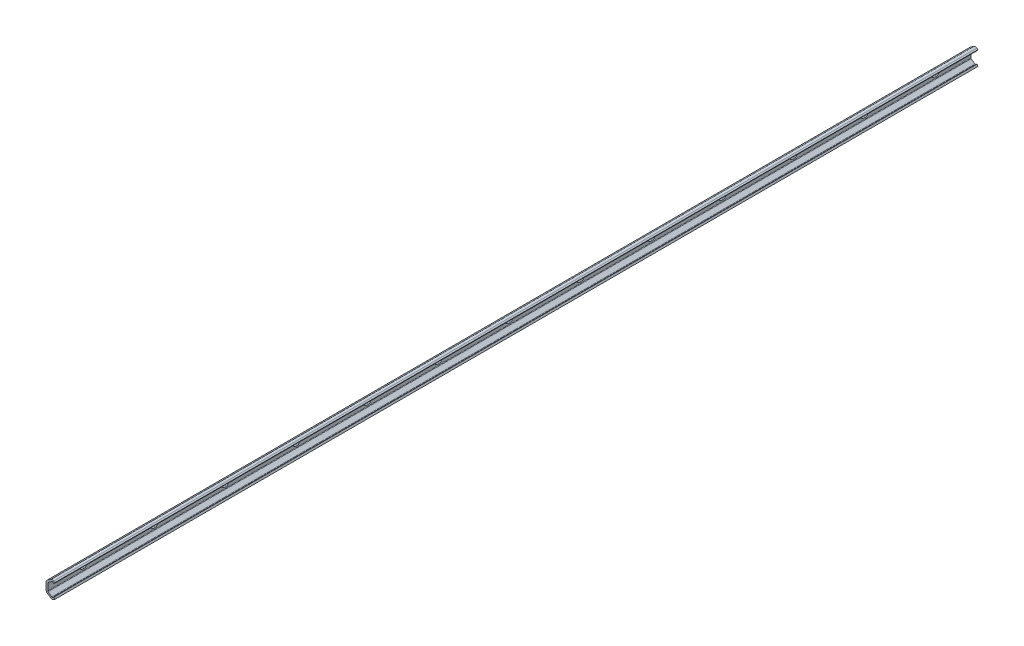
ISO-10303-21;
HEADER;
FILE_DESCRIPTION(('STEP AP214'),'2;1');
FILE_NAME('part.step','',(''),(''),'','','');
FILE_SCHEMA(('AUTOMOTIVE_DESIGN { 1 0 10303 214 1 1 1 1 }'));
ENDSEC;
DATA;
#1=APPLICATION_CONTEXT('core data for automotive mechanical design processes');
#2=APPLICATION_PROTOCOL_DEFINITION('international standard','automotive_design',2000,#1);
#3=PRODUCT_CONTEXT('',#1,'mechanical');
#4=PRODUCT('Part','Part','',(#3));
#5=PRODUCT_RELATED_PRODUCT_CATEGORY('part','',(#4));
#6=PRODUCT_DEFINITION_FORMATION('','',#4);
#7=PRODUCT_DEFINITION_CONTEXT('part definition',#1,'design');
#8=PRODUCT_DEFINITION('design','',#6,#7);
#9=PRODUCT_DEFINITION_SHAPE('','',#8);
#10=(LENGTH_UNIT() NAMED_UNIT(*) SI_UNIT(.MILLI.,.METRE.));
#11=(NAMED_UNIT(*) PLANE_ANGLE_UNIT() SI_UNIT($,.RADIAN.));
#12=(NAMED_UNIT(*) SI_UNIT($,.STERADIAN.) SOLID_ANGLE_UNIT());
#13=UNCERTAINTY_MEASURE_WITH_UNIT(LENGTH_MEASURE(1.E-05),#10,'distance_accuracy_value','');
#14=(GEOMETRIC_REPRESENTATION_CONTEXT(3) GLOBAL_UNCERTAINTY_ASSIGNED_CONTEXT((#13)) GLOBAL_UNIT_ASSIGNED_CONTEXT((#10,
#11,#12)) REPRESENTATION_CONTEXT('',''));
#15=CARTESIAN_POINT('',(0.,0.,0.));
#16=DIRECTION('',(0.,0.,1.));
#17=DIRECTION('',(1.,0.,0.));
#18=AXIS2_PLACEMENT_3D('',#15,#16,#17);
#19=CARTESIAN_POINT('',(7.52196603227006,7.45296627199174,-1040.));
#20=DIRECTION('',(-0.573576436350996,-0.819152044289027,0.));
#21=DIRECTION('',(0.819152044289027,-0.573576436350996,0.));
#22=AXIS2_PLACEMENT_3D('',#19,#20,#21);
#23=PLANE('',#22);
#24=DIRECTION('',(0.819152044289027,-0.573576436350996,0.));
#25=VECTOR('',#24,1.);
#26=CARTESIAN_POINT('',(7.52196603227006,7.45296627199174,0.));
#27=LINE('',#26,#25);
#28=CARTESIAN_POINT('',(7.52196603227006,7.45296627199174,0.));
#29=VERTEX_POINT('',#28);
#30=CARTESIAN_POINT('',(8.85284712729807,6.52107329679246,0.));
#31=VERTEX_POINT('',#30);
#32=EDGE_CURVE('E579',#29,#31,#27,.T.);
#33=ORIENTED_EDGE('',*,*,#32,.F.);
#34=DIRECTION('',(0.,0.,1.));
#35=VECTOR('',#34,1.);
#36=CARTESIAN_POINT('',(7.52196603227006,7.45296627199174,-1040.));
#37=LINE('',#36,#35);
#38=CARTESIAN_POINT('',(7.52196603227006,7.45296627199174,-1040.));
#39=VERTEX_POINT('',#38);
#40=EDGE_CURVE('E749',#39,#29,#37,.T.);
#41=ORIENTED_EDGE('',*,*,#40,.F.);
#42=DIRECTION('',(0.819152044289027,-0.573576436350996,0.));
#43=VECTOR('',#42,1.);
#44=CARTESIAN_POINT('',(7.52196603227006,7.45296627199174,-1040.));
#45=LINE('',#44,#43);
#46=CARTESIAN_POINT('',(8.85284712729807,6.52107329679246,-1040.));
#47=VERTEX_POINT('',#46);
#48=EDGE_CURVE('E589',#39,#47,#45,.T.);
#49=ORIENTED_EDGE('',*,*,#48,.T.);
#50=DIRECTION('',(0.,0.,1.));
#51=VECTOR('',#50,1.);
#52=CARTESIAN_POINT('',(8.85284712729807,6.52107329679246,-1040.));
#53=LINE('',#52,#51);
#54=EDGE_CURVE('E670',#47,#31,#53,.T.);
#55=ORIENTED_EDGE('',*,*,#54,.T.);
#56=EDGE_LOOP('',(#33,#41,#49,#55));
#57=FACE_BOUND('',#56,.T.);
#58=ADVANCED_FACE('F39',(#57),#23,.T.);
#59=CARTESIAN_POINT('',(7.00000000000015,6.70752152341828,-1040.));
#60=DIRECTION('',(0.,0.,1.));
#61=DIRECTION('',(1.,0.,0.));
#62=AXIS2_PLACEMENT_3D('',#59,#60,#61);
#63=CYLINDRICAL_SURFACE('',#62,0.910020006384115);
#64=CARTESIAN_POINT('',(7.00000000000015,6.70752152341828,0.));
#65=DIRECTION('',(0.,0.,-1.));
#66=DIRECTION('',(-1.,0.,0.));
#67=AXIS2_PLACEMENT_3D('',#64,#65,#66);
#68=CIRCLE('',#67,0.910020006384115);
#69=CARTESIAN_POINT('',(6.47803396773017,7.4529662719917,0.));
#70=VERTEX_POINT('',#69);
#71=EDGE_CURVE('E594',#70,#29,#68,.T.);
#72=ORIENTED_EDGE('',*,*,#71,.F.);
#73=DIRECTION('',(0.,0.,1.));
#74=VECTOR('',#73,1.);
#75=CARTESIAN_POINT('',(6.47803396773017,7.4529662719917,-1040.));
#76=LINE('',#75,#74);
#77=CARTESIAN_POINT('',(6.47803396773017,7.4529662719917,-1040.));
#78=VERTEX_POINT('',#77);
#79=EDGE_CURVE('E753',#78,#70,#76,.T.);
#80=ORIENTED_EDGE('',*,*,#79,.F.);
#81=CARTESIAN_POINT('',(7.00000000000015,6.70752152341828,-1040.));
#82=DIRECTION('',(0.,0.,-1.));
#83=DIRECTION('',(-1.,0.,0.));
#84=AXIS2_PLACEMENT_3D('',#81,#82,#83);
#85=CIRCLE('',#84,0.910020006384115);
#86=EDGE_CURVE('E666',#78,#39,#85,.T.);
#87=ORIENTED_EDGE('',*,*,#86,.T.);
#88=ORIENTED_EDGE('',*,*,#40,.T.);
#89=EDGE_LOOP('',(#72,#80,#87,#88));
#90=FACE_BOUND('',#89,.T.);
#91=ADVANCED_FACE('F1300',(#90),#63,.F.);
#92=CARTESIAN_POINT('',(2.36906085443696,4.57583232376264,-1040.));
#93=DIRECTION('',(0.573576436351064,-0.819152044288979,0.));
#94=DIRECTION('',(0.819152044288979,0.573576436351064,0.));
#95=AXIS2_PLACEMENT_3D('',#92,#93,#94);
#96=PLANE('',#95);
#97=DIRECTION('',(0.819152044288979,0.573576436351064,0.));
#98=VECTOR('',#97,1.);
#99=CARTESIAN_POINT('',(2.36906085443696,4.57583232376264,0.));
#100=LINE('',#99,#98);
#101=CARTESIAN_POINT('',(2.36906085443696,4.57583232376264,0.));
#102=VERTEX_POINT('',#101);
#103=EDGE_CURVE('E742',#102,#70,#100,.T.);
#104=ORIENTED_EDGE('',*,*,#103,.F.);
#105=DIRECTION('',(0.,0.,1.));
#106=VECTOR('',#105,1.);
#107=CARTESIAN_POINT('',(2.36906085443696,4.57583232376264,-1040.));
#108=LINE('',#107,#106);
#109=CARTESIAN_POINT('',(2.36906085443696,4.57583232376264,-1040.));
#110=VERTEX_POINT('',#109);
#111=EDGE_CURVE('E756',#110,#102,#108,.T.);
#112=ORIENTED_EDGE('',*,*,#111,.F.);
#113=DIRECTION('',(0.819152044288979,0.573576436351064,0.));
#114=VECTOR('',#113,1.);
#115=CARTESIAN_POINT('',(2.36906085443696,4.57583232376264,-1040.));
#116=LINE('',#115,#114);
#117=EDGE_CURVE('E662',#110,#78,#116,.T.);
#118=ORIENTED_EDGE('',*,*,#117,.T.);
#119=ORIENTED_EDGE('',*,*,#79,.T.);
#120=EDGE_LOOP('',(#104,#112,#118,#119));
#121=FACE_BOUND('',#120,.T.);
#122=ADVANCED_FACE('F1306',(#121),#96,.T.);
#123=CARTESIAN_POINT('',(3.00000000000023,3.79999999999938,-1040.));
#124=DIRECTION('',(0.,0.,1.));
#125=DIRECTION('',(1.,0.,0.));
#126=AXIS2_PLACEMENT_3D('',#123,#124,#125);
#127=CYLINDRICAL_SURFACE('',#126,1.);
#128=CARTESIAN_POINT('',(3.00000000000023,3.79999999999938,0.));
#129=DIRECTION('',(0.,0.,-1.));
#130=DIRECTION('',(-1.,0.,0.));
#131=AXIS2_PLACEMENT_3D('',#128,#129,#130);
#132=CIRCLE('',#131,1.);
#133=CARTESIAN_POINT('',(2.00000000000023,3.79999999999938,0.));
#134=VERTEX_POINT('',#133);
#135=EDGE_CURVE('E738',#134,#102,#132,.T.);
#136=ORIENTED_EDGE('',*,*,#135,.F.);
#137=DIRECTION('',(0.,0.,1.));
#138=VECTOR('',#137,1.);
#139=CARTESIAN_POINT('',(2.00000000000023,3.79999999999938,-1040.));
#140=LINE('',#139,#138);
#141=CARTESIAN_POINT('',(2.00000000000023,3.79999999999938,-1040.));
#142=VERTEX_POINT('',#141);
#143=EDGE_CURVE('E759',#142,#134,#140,.T.);
#144=ORIENTED_EDGE('',*,*,#143,.F.);
#145=CARTESIAN_POINT('',(3.00000000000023,3.79999999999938,-1040.));
#146=DIRECTION('',(0.,0.,-1.));
#147=DIRECTION('',(-1.,0.,0.));
#148=AXIS2_PLACEMENT_3D('',#145,#146,#147);
#149=CIRCLE('',#148,1.);
#150=EDGE_CURVE('E658',#142,#110,#149,.T.);
#151=ORIENTED_EDGE('',*,*,#150,.T.);
#152=ORIENTED_EDGE('',*,*,#111,.T.);
#153=EDGE_LOOP('',(#136,#144,#151,#152));
#154=FACE_BOUND('',#153,.T.);
#155=ADVANCED_FACE('F1487',(#154),#127,.F.);
#156=CARTESIAN_POINT('',(2.00000000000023,-3.80000000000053,-1040.));
#157=DIRECTION('',(1.,0.,0.));
#158=DIRECTION('',(0.,1.,0.));
#159=AXIS2_PLACEMENT_3D('',#156,#157,#158);
#160=PLANE('',#159);
#161=CARTESIAN_POINT('',(2.00000000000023,0.,-118.75));
#162=DIRECTION('',(1.,0.,0.));
#163=DIRECTION('',(0.,1.,0.));
#164=AXIS2_PLACEMENT_3D('',#161,#162,#163);
#165=CIRCLE('',#164,2.25);
#166=CARTESIAN_POINT('',(2.00000000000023,2.25,-118.75));
#167=VERTEX_POINT('',#166);
#168=CARTESIAN_POINT('',(2.00000000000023,-2.25,-118.75));
#169=VERTEX_POINT('',#168);
#170=EDGE_CURVE('E538',#167,#169,#165,.T.);
#171=ORIENTED_EDGE('',*,*,#170,.F.);
#172=DIRECTION('',(0.,0.,1.));
#173=VECTOR('',#172,1.);
#174=CARTESIAN_POINT('',(2.00000000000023,2.25,-118.75));
#175=LINE('',#174,#173);
#176=CARTESIAN_POINT('',(2.00000000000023,2.25,-121.25));
#177=VERTEX_POINT('',#176);
#178=EDGE_CURVE('E515',#177,#167,#175,.T.);
#179=ORIENTED_EDGE('',*,*,#178,.F.);
#180=CARTESIAN_POINT('',(2.00000000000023,0.,-121.25));
#181=DIRECTION('',(1.,0.,0.));
#182=DIRECTION('',(0.,1.,0.));
#183=AXIS2_PLACEMENT_3D('',#180,#181,#182);
#184=CIRCLE('',#183,2.25);
#185=CARTESIAN_POINT('',(2.00000000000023,-2.25,-121.25));
#186=VERTEX_POINT('',#185);
#187=EDGE_CURVE('E506',#186,#177,#184,.T.);
#188=ORIENTED_EDGE('',*,*,#187,.F.);
#189=DIRECTION('',(0.,0.,-1.));
#190=VECTOR('',#189,1.);
#191=CARTESIAN_POINT('',(2.00000000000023,-2.25,-118.75));
#192=LINE('',#191,#190);
#193=EDGE_CURVE('E491',#169,#186,#192,.T.);
#194=ORIENTED_EDGE('',*,*,#193,.F.);
#195=EDGE_LOOP('',(#171,#179,#188,#194));
#196=FACE_BOUND('',#195,.T.);
#197=CARTESIAN_POINT('',(2.00000000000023,0.,-38.75));
#198=DIRECTION('',(1.,0.,0.));
#199=DIRECTION('',(0.,1.,0.));
#200=AXIS2_PLACEMENT_3D('',#197,#198,#199);
#201=CIRCLE('',#200,2.25);
#202=CARTESIAN_POINT('',(2.00000000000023,2.25,-38.75));
#203=VERTEX_POINT('',#202);
#204=CARTESIAN_POINT('',(2.00000000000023,-2.25,-38.7499999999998));
#205=VERTEX_POINT('',#204);
#206=EDGE_CURVE('E544',#203,#205,#201,.T.);
#207=ORIENTED_EDGE('',*,*,#206,.F.);
#208=DIRECTION('',(0.,0.,1.));
#209=VECTOR('',#208,1.);
#210=CARTESIAN_POINT('',(2.00000000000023,2.25,-38.75));
#211=LINE('',#210,#209);
#212=CARTESIAN_POINT('',(2.00000000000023,2.25,-41.25));
#213=VERTEX_POINT('',#212);
#214=EDGE_CURVE('E550',#213,#203,#211,.T.);
#215=ORIENTED_EDGE('',*,*,#214,.F.);
#216=CARTESIAN_POINT('',(2.00000000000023,0.,-41.25));
#217=DIRECTION('',(1.,0.,0.));
#218=DIRECTION('',(0.,1.,0.));
#219=AXIS2_PLACEMENT_3D('',#216,#217,#218);
#220=CIRCLE('',#219,2.25);
#221=CARTESIAN_POINT('',(2.00000000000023,-2.25,-41.25));
#222=VERTEX_POINT('',#221);
#223=EDGE_CURVE('E569',#222,#213,#220,.T.);
#224=ORIENTED_EDGE('',*,*,#223,.F.);
#225=DIRECTION('',(0.,0.,-1.));
#226=VECTOR('',#225,1.);
#227=CARTESIAN_POINT('',(2.00000000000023,-2.25,-38.75));
#228=LINE('',#227,#226);
#229=EDGE_CURVE('E565',#205,#222,#228,.T.);
#230=ORIENTED_EDGE('',*,*,#229,.F.);
#231=EDGE_LOOP('',(#207,#215,#224,#230));
#232=FACE_BOUND('',#231,.T.);
#233=DIRECTION('',(0.,1.,0.));
#234=VECTOR('',#233,1.);
#235=CARTESIAN_POINT('',(2.00000000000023,-3.80000000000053,0.));
#236=LINE('',#235,#234);
#237=CARTESIAN_POINT('',(2.00000000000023,-3.80000000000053,0.));
#238=VERTEX_POINT('',#237);
#239=EDGE_CURVE('E734',#238,#134,#236,.T.);
#240=ORIENTED_EDGE('',*,*,#239,.F.);
#241=DIRECTION('',(0.,0.,1.));
#242=VECTOR('',#241,1.);
#243=CARTESIAN_POINT('',(2.00000000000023,-3.80000000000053,-1040.));
#244=LINE('',#243,#242);
#245=CARTESIAN_POINT('',(2.00000000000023,-3.80000000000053,-1040.));
#246=VERTEX_POINT('',#245);
#247=EDGE_CURVE('E762',#246,#238,#244,.T.);
#248=ORIENTED_EDGE('',*,*,#247,.F.);
#249=DIRECTION('',(0.,1.,0.));
#250=VECTOR('',#249,1.);
#251=CARTESIAN_POINT('',(2.00000000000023,-3.80000000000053,-1040.));
#252=LINE('',#251,#250);
#253=EDGE_CURVE('E654',#246,#142,#252,.T.);
#254=ORIENTED_EDGE('',*,*,#253,.T.);
#255=ORIENTED_EDGE('',*,*,#143,.T.);
#256=EDGE_LOOP('',(#240,#248,#254,#255));
#257=FACE_BOUND('',#256,.T.);
#258=CARTESIAN_POINT('',(2.00000000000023,0.,-198.75));
#259=DIRECTION('',(1.,0.,0.));
#260=DIRECTION('',(0.,1.,0.));
#261=AXIS2_PLACEMENT_3D('',#258,#259,#260);
#262=CIRCLE('',#261,2.25);
#263=CARTESIAN_POINT('',(2.00000000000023,2.25,-198.75));
#264=VERTEX_POINT('',#263);
#265=CARTESIAN_POINT('',(2.00000000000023,-2.25,-198.75));
#266=VERTEX_POINT('',#265);
#267=EDGE_CURVE('E752',#264,#266,#262,.T.);
#268=ORIENTED_EDGE('',*,*,#267,.F.);
#269=DIRECTION('',(0.,0.,1.));
#270=VECTOR('',#269,1.);
#271=CARTESIAN_POINT('',(2.00000000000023,2.25,-198.75));
#272=LINE('',#271,#270);
#273=CARTESIAN_POINT('',(2.00000000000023,2.25,-201.25));
#274=VERTEX_POINT('',#273);
#275=EDGE_CURVE('E811',#274,#264,#272,.T.);
#276=ORIENTED_EDGE('',*,*,#275,.F.);
#277=CARTESIAN_POINT('',(2.00000000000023,0.,-201.25));
#278=DIRECTION('',(1.,0.,0.));
#279=DIRECTION('',(0.,1.,0.));
#280=AXIS2_PLACEMENT_3D('',#277,#278,#279);
#281=CIRCLE('',#280,2.25);
#282=CARTESIAN_POINT('',(2.00000000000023,-2.25,-201.25));
#283=VERTEX_POINT('',#282);
#284=EDGE_CURVE('E815',#283,#274,#281,.T.);
#285=ORIENTED_EDGE('',*,*,#284,.F.);
#286=DIRECTION('',(0.,0.,-1.));
#287=VECTOR('',#286,1.);
#288=CARTESIAN_POINT('',(2.00000000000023,-2.25,-198.75));
#289=LINE('',#288,#287);
#290=EDGE_CURVE('E819',#266,#283,#289,.T.);
#291=ORIENTED_EDGE('',*,*,#290,.F.);
#292=EDGE_LOOP('',(#268,#276,#285,#291));
#293=FACE_BOUND('',#292,.T.);
#294=CARTESIAN_POINT('',(2.00000000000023,0.,-278.75));
#295=DIRECTION('',(1.,0.,0.));
#296=DIRECTION('',(0.,1.,0.));
#297=AXIS2_PLACEMENT_3D('',#294,#295,#296);
#298=CIRCLE('',#297,2.25);
#299=CARTESIAN_POINT('',(2.00000000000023,2.25,-278.75));
#300=VERTEX_POINT('',#299);
#301=CARTESIAN_POINT('',(2.00000000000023,-2.25,-278.75));
#302=VERTEX_POINT('',#301);
#303=EDGE_CURVE('E852',#300,#302,#298,.T.);
#304=ORIENTED_EDGE('',*,*,#303,.F.);
#305=DIRECTION('',(0.,0.,1.));
#306=VECTOR('',#305,1.);
#307=CARTESIAN_POINT('',(2.00000000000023,2.25,-278.75));
#308=LINE('',#307,#306);
#309=CARTESIAN_POINT('',(2.00000000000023,2.25,-281.25));
#310=VERTEX_POINT('',#309);
#311=EDGE_CURVE('E855',#310,#300,#308,.T.);
#312=ORIENTED_EDGE('',*,*,#311,.F.);
#313=CARTESIAN_POINT('',(2.00000000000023,0.,-281.25));
#314=DIRECTION('',(1.,0.,0.));
#315=DIRECTION('',(0.,1.,0.));
#316=AXIS2_PLACEMENT_3D('',#313,#314,#315);
#317=CIRCLE('',#316,2.25);
#318=CARTESIAN_POINT('',(2.00000000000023,-2.25,-281.25));
#319=VERTEX_POINT('',#318);
#320=EDGE_CURVE('E859',#319,#310,#317,.T.);
#321=ORIENTED_EDGE('',*,*,#320,.F.);
#322=DIRECTION('',(0.,0.,-1.));
#323=VECTOR('',#322,1.);
#324=CARTESIAN_POINT('',(2.00000000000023,-2.25,-278.75));
#325=LINE('',#324,#323);
#326=EDGE_CURVE('E863',#302,#319,#325,.T.);
#327=ORIENTED_EDGE('',*,*,#326,.F.);
#328=EDGE_LOOP('',(#304,#312,#321,#327));
#329=FACE_BOUND('',#328,.T.);
#330=CARTESIAN_POINT('',(2.00000000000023,0.,-358.75));
#331=DIRECTION('',(1.,0.,0.));
#332=DIRECTION('',(0.,1.,0.));
#333=AXIS2_PLACEMENT_3D('',#330,#331,#332);
#334=CIRCLE('',#333,2.25);
#335=CARTESIAN_POINT('',(2.00000000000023,2.25,-358.75));
#336=VERTEX_POINT('',#335);
#337=CARTESIAN_POINT('',(2.00000000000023,-2.25,-358.75));
#338=VERTEX_POINT('',#337);
#339=EDGE_CURVE('E896',#336,#338,#334,.T.);
#340=ORIENTED_EDGE('',*,*,#339,.F.);
#341=DIRECTION('',(0.,0.,1.));
#342=VECTOR('',#341,1.);
#343=CARTESIAN_POINT('',(2.00000000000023,2.25,-358.75));
#344=LINE('',#343,#342);
#345=CARTESIAN_POINT('',(2.00000000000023,2.25,-361.25));
#346=VERTEX_POINT('',#345);
#347=EDGE_CURVE('E899',#346,#336,#344,.T.);
#348=ORIENTED_EDGE('',*,*,#347,.F.);
#349=CARTESIAN_POINT('',(2.00000000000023,0.,-361.25));
#350=DIRECTION('',(1.,0.,0.));
#351=DIRECTION('',(0.,1.,0.));
#352=AXIS2_PLACEMENT_3D('',#349,#350,#351);
#353=CIRCLE('',#352,2.25);
#354=CARTESIAN_POINT('',(2.00000000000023,-2.25,-361.25));
#355=VERTEX_POINT('',#354);
#356=EDGE_CURVE('E903',#355,#346,#353,.T.);
#357=ORIENTED_EDGE('',*,*,#356,.F.);
#358=DIRECTION('',(0.,0.,-1.));
#359=VECTOR('',#358,1.);
#360=CARTESIAN_POINT('',(2.00000000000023,-2.25,-358.75));
#361=LINE('',#360,#359);
#362=EDGE_CURVE('E907',#338,#355,#361,.T.);
#363=ORIENTED_EDGE('',*,*,#362,.F.);
#364=EDGE_LOOP('',(#340,#348,#357,#363));
#365=FACE_BOUND('',#364,.T.);
#366=CARTESIAN_POINT('',(2.00000000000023,0.,-438.75));
#367=DIRECTION('',(1.,0.,0.));
#368=DIRECTION('',(0.,1.,0.));
#369=AXIS2_PLACEMENT_3D('',#366,#367,#368);
#370=CIRCLE('',#369,2.25);
#371=CARTESIAN_POINT('',(2.00000000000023,2.25,-438.75));
#372=VERTEX_POINT('',#371);
#373=CARTESIAN_POINT('',(2.00000000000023,-2.25,-438.75));
#374=VERTEX_POINT('',#373);
#375=EDGE_CURVE('E940',#372,#374,#370,.T.);
#376=ORIENTED_EDGE('',*,*,#375,.F.);
#377=DIRECTION('',(0.,0.,1.));
#378=VECTOR('',#377,1.);
#379=CARTESIAN_POINT('',(2.00000000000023,2.25,-438.75));
#380=LINE('',#379,#378);
#381=CARTESIAN_POINT('',(2.00000000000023,2.25,-441.25));
#382=VERTEX_POINT('',#381);
#383=EDGE_CURVE('E943',#382,#372,#380,.T.);
#384=ORIENTED_EDGE('',*,*,#383,.F.);
#385=CARTESIAN_POINT('',(2.00000000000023,0.,-441.25));
#386=DIRECTION('',(1.,0.,0.));
#387=DIRECTION('',(0.,1.,0.));
#388=AXIS2_PLACEMENT_3D('',#385,#386,#387);
#389=CIRCLE('',#388,2.25);
#390=CARTESIAN_POINT('',(2.00000000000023,-2.25,-441.25));
#391=VERTEX_POINT('',#390);
#392=EDGE_CURVE('E947',#391,#382,#389,.T.);
#393=ORIENTED_EDGE('',*,*,#392,.F.);
#394=DIRECTION('',(0.,0.,-1.));
#395=VECTOR('',#394,1.);
#396=CARTESIAN_POINT('',(2.00000000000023,-2.25,-438.75));
#397=LINE('',#396,#395);
#398=EDGE_CURVE('E951',#374,#391,#397,.T.);
#399=ORIENTED_EDGE('',*,*,#398,.F.);
#400=EDGE_LOOP('',(#376,#384,#393,#399));
#401=FACE_BOUND('',#400,.T.);
#402=CARTESIAN_POINT('',(2.00000000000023,0.,-518.75));
#403=DIRECTION('',(1.,0.,0.));
#404=DIRECTION('',(0.,1.,0.));
#405=AXIS2_PLACEMENT_3D('',#402,#403,#404);
#406=CIRCLE('',#405,2.25);
#407=CARTESIAN_POINT('',(2.00000000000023,2.25,-518.75));
#408=VERTEX_POINT('',#407);
#409=CARTESIAN_POINT('',(2.00000000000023,-2.25,-518.75));
#410=VERTEX_POINT('',#409);
#411=EDGE_CURVE('E984',#408,#410,#406,.T.);
#412=ORIENTED_EDGE('',*,*,#411,.F.);
#413=DIRECTION('',(0.,0.,1.));
#414=VECTOR('',#413,1.);
#415=CARTESIAN_POINT('',(2.00000000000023,2.25,-518.75));
#416=LINE('',#415,#414);
#417=CARTESIAN_POINT('',(2.00000000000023,2.25,-521.25));
#418=VERTEX_POINT('',#417);
#419=EDGE_CURVE('E987',#418,#408,#416,.T.);
#420=ORIENTED_EDGE('',*,*,#419,.F.);
#421=CARTESIAN_POINT('',(2.00000000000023,0.,-521.25));
#422=DIRECTION('',(1.,0.,0.));
#423=DIRECTION('',(0.,1.,0.));
#424=AXIS2_PLACEMENT_3D('',#421,#422,#423);
#425=CIRCLE('',#424,2.25);
#426=CARTESIAN_POINT('',(2.00000000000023,-2.25,-521.25));
#427=VERTEX_POINT('',#426);
#428=EDGE_CURVE('E991',#427,#418,#425,.T.);
#429=ORIENTED_EDGE('',*,*,#428,.F.);
#430=DIRECTION('',(0.,0.,-1.));
#431=VECTOR('',#430,1.);
#432=CARTESIAN_POINT('',(2.00000000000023,-2.25,-518.75));
#433=LINE('',#432,#431);
#434=EDGE_CURVE('E995',#410,#427,#433,.T.);
#435=ORIENTED_EDGE('',*,*,#434,.F.);
#436=EDGE_LOOP('',(#412,#420,#429,#435));
#437=FACE_BOUND('',#436,.T.);
#438=CARTESIAN_POINT('',(2.00000000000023,0.,-598.75));
#439=DIRECTION('',(1.,0.,0.));
#440=DIRECTION('',(0.,1.,0.));
#441=AXIS2_PLACEMENT_3D('',#438,#439,#440);
#442=CIRCLE('',#441,2.25);
#443=CARTESIAN_POINT('',(2.00000000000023,2.25,-598.75));
#444=VERTEX_POINT('',#443);
#445=CARTESIAN_POINT('',(2.00000000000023,-2.25,-598.75));
#446=VERTEX_POINT('',#445);
#447=EDGE_CURVE('E1028',#444,#446,#442,.T.);
#448=ORIENTED_EDGE('',*,*,#447,.F.);
#449=DIRECTION('',(0.,0.,1.));
#450=VECTOR('',#449,1.);
#451=CARTESIAN_POINT('',(2.00000000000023,2.25,-598.75));
#452=LINE('',#451,#450);
#453=CARTESIAN_POINT('',(2.00000000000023,2.25,-601.25));
#454=VERTEX_POINT('',#453);
#455=EDGE_CURVE('E1031',#454,#444,#452,.T.);
#456=ORIENTED_EDGE('',*,*,#455,.F.);
#457=CARTESIAN_POINT('',(2.00000000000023,0.,-601.25));
#458=DIRECTION('',(1.,0.,0.));
#459=DIRECTION('',(0.,1.,0.));
#460=AXIS2_PLACEMENT_3D('',#457,#458,#459);
#461=CIRCLE('',#460,2.25);
#462=CARTESIAN_POINT('',(2.00000000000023,-2.25,-601.25));
#463=VERTEX_POINT('',#462);
#464=EDGE_CURVE('E1034',#463,#454,#461,.T.);
#465=ORIENTED_EDGE('',*,*,#464,.F.);
#466=DIRECTION('',(0.,0.,-1.));
#467=VECTOR('',#466,1.);
#468=CARTESIAN_POINT('',(2.00000000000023,-2.25,-598.75));
#469=LINE('',#468,#467);
#470=EDGE_CURVE('E1038',#446,#463,#469,.T.);
#471=ORIENTED_EDGE('',*,*,#470,.F.);
#472=EDGE_LOOP('',(#448,#456,#465,#471));
#473=FACE_BOUND('',#472,.T.);
#474=CARTESIAN_POINT('',(2.00000000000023,0.,-678.75));
#475=DIRECTION('',(1.,0.,0.));
#476=DIRECTION('',(0.,1.,0.));
#477=AXIS2_PLACEMENT_3D('',#474,#475,#476);
#478=CIRCLE('',#477,2.25);
#479=CARTESIAN_POINT('',(2.00000000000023,2.25,-678.75));
#480=VERTEX_POINT('',#479);
#481=CARTESIAN_POINT('',(2.00000000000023,-2.25,-678.75));
#482=VERTEX_POINT('',#481);
#483=EDGE_CURVE('E1071',#480,#482,#478,.T.);
#484=ORIENTED_EDGE('',*,*,#483,.F.);
#485=DIRECTION('',(0.,0.,1.));
#486=VECTOR('',#485,1.);
#487=CARTESIAN_POINT('',(2.00000000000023,2.25,-678.75));
#488=LINE('',#487,#486);
#489=CARTESIAN_POINT('',(2.00000000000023,2.25,-681.25));
#490=VERTEX_POINT('',#489);
#491=EDGE_CURVE('E1074',#490,#480,#488,.T.);
#492=ORIENTED_EDGE('',*,*,#491,.F.);
#493=CARTESIAN_POINT('',(2.00000000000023,0.,-681.25));
#494=DIRECTION('',(1.,0.,0.));
#495=DIRECTION('',(0.,1.,0.));
#496=AXIS2_PLACEMENT_3D('',#493,#494,#495);
#497=CIRCLE('',#496,2.25);
#498=CARTESIAN_POINT('',(2.00000000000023,-2.25,-681.25));
#499=VERTEX_POINT('',#498);
#500=EDGE_CURVE('E1078',#499,#490,#497,.T.);
#501=ORIENTED_EDGE('',*,*,#500,.F.);
#502=DIRECTION('',(0.,0.,-1.));
#503=VECTOR('',#502,1.);
#504=CARTESIAN_POINT('',(2.00000000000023,-2.25,-678.75));
#505=LINE('',#504,#503);
#506=EDGE_CURVE('E1082',#482,#499,#505,.T.);
#507=ORIENTED_EDGE('',*,*,#506,.F.);
#508=EDGE_LOOP('',(#484,#492,#501,#507));
#509=FACE_BOUND('',#508,.T.);
#510=CARTESIAN_POINT('',(2.00000000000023,0.,-758.75));
#511=DIRECTION('',(1.,0.,0.));
#512=DIRECTION('',(0.,1.,0.));
#513=AXIS2_PLACEMENT_3D('',#510,#511,#512);
#514=CIRCLE('',#513,2.25);
#515=CARTESIAN_POINT('',(2.00000000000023,2.25,-758.75));
#516=VERTEX_POINT('',#515);
#517=CARTESIAN_POINT('',(2.00000000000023,-2.25,-758.75));
#518=VERTEX_POINT('',#517);
#519=EDGE_CURVE('E1115',#516,#518,#514,.T.);
#520=ORIENTED_EDGE('',*,*,#519,.F.);
#521=DIRECTION('',(0.,0.,1.));
#522=VECTOR('',#521,1.);
#523=CARTESIAN_POINT('',(2.00000000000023,2.25,-758.75));
#524=LINE('',#523,#522);
#525=CARTESIAN_POINT('',(2.00000000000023,2.25,-761.25));
#526=VERTEX_POINT('',#525);
#527=EDGE_CURVE('E1118',#526,#516,#524,.T.);
#528=ORIENTED_EDGE('',*,*,#527,.F.);
#529=CARTESIAN_POINT('',(2.00000000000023,0.,-761.25));
#530=DIRECTION('',(1.,0.,0.));
#531=DIRECTION('',(0.,1.,0.));
#532=AXIS2_PLACEMENT_3D('',#529,#530,#531);
#533=CIRCLE('',#532,2.25);
#534=CARTESIAN_POINT('',(2.00000000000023,-2.25,-761.25));
#535=VERTEX_POINT('',#534);
#536=EDGE_CURVE('E1122',#535,#526,#533,.T.);
#537=ORIENTED_EDGE('',*,*,#536,.F.);
#538=DIRECTION('',(0.,0.,-1.));
#539=VECTOR('',#538,1.);
#540=CARTESIAN_POINT('',(2.00000000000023,-2.25,-758.75));
#541=LINE('',#540,#539);
#542=EDGE_CURVE('E1126',#518,#535,#541,.T.);
#543=ORIENTED_EDGE('',*,*,#542,.F.);
#544=EDGE_LOOP('',(#520,#528,#537,#543));
#545=FACE_BOUND('',#544,.T.);
#546=CARTESIAN_POINT('',(2.00000000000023,0.,-838.75));
#547=DIRECTION('',(1.,0.,0.));
#548=DIRECTION('',(0.,1.,0.));
#549=AXIS2_PLACEMENT_3D('',#546,#547,#548);
#550=CIRCLE('',#549,2.25);
#551=CARTESIAN_POINT('',(2.00000000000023,2.25,-838.75));
#552=VERTEX_POINT('',#551);
#553=CARTESIAN_POINT('',(2.00000000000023,-2.25,-838.75));
#554=VERTEX_POINT('',#553);
#555=EDGE_CURVE('E1159',#552,#554,#550,.T.);
#556=ORIENTED_EDGE('',*,*,#555,.F.);
#557=DIRECTION('',(0.,0.,1.));
#558=VECTOR('',#557,1.);
#559=CARTESIAN_POINT('',(2.00000000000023,2.25,-838.75));
#560=LINE('',#559,#558);
#561=CARTESIAN_POINT('',(2.00000000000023,2.25,-841.25));
#562=VERTEX_POINT('',#561);
#563=EDGE_CURVE('E1162',#562,#552,#560,.T.);
#564=ORIENTED_EDGE('',*,*,#563,.F.);
#565=CARTESIAN_POINT('',(2.00000000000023,0.,-841.25));
#566=DIRECTION('',(1.,0.,0.));
#567=DIRECTION('',(0.,1.,0.));
#568=AXIS2_PLACEMENT_3D('',#565,#566,#567);
#569=CIRCLE('',#568,2.25);
#570=CARTESIAN_POINT('',(2.00000000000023,-2.25,-841.25));
#571=VERTEX_POINT('',#570);
#572=EDGE_CURVE('E1166',#571,#562,#569,.T.);
#573=ORIENTED_EDGE('',*,*,#572,.F.);
#574=DIRECTION('',(0.,0.,-1.));
#575=VECTOR('',#574,1.);
#576=CARTESIAN_POINT('',(2.00000000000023,-2.25,-838.75));
#577=LINE('',#576,#575);
#578=EDGE_CURVE('E1170',#554,#571,#577,.T.);
#579=ORIENTED_EDGE('',*,*,#578,.F.);
#580=EDGE_LOOP('',(#556,#564,#573,#579));
#581=FACE_BOUND('',#580,.T.);
#582=CARTESIAN_POINT('',(2.00000000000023,0.,-918.75));
#583=DIRECTION('',(1.,0.,0.));
#584=DIRECTION('',(0.,1.,0.));
#585=AXIS2_PLACEMENT_3D('',#582,#583,#584);
#586=CIRCLE('',#585,2.25);
#587=CARTESIAN_POINT('',(2.00000000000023,2.25,-918.75));
#588=VERTEX_POINT('',#587);
#589=CARTESIAN_POINT('',(2.00000000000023,-2.25,-918.75));
#590=VERTEX_POINT('',#589);
#591=EDGE_CURVE('E1203',#588,#590,#586,.T.);
#592=ORIENTED_EDGE('',*,*,#591,.F.);
#593=DIRECTION('',(0.,0.,1.));
#594=VECTOR('',#593,1.);
#595=CARTESIAN_POINT('',(2.00000000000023,2.25,-918.75));
#596=LINE('',#595,#594);
#597=CARTESIAN_POINT('',(2.00000000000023,2.25,-921.25));
#598=VERTEX_POINT('',#597);
#599=EDGE_CURVE('E1206',#598,#588,#596,.T.);
#600=ORIENTED_EDGE('',*,*,#599,.F.);
#601=CARTESIAN_POINT('',(2.00000000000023,0.,-921.25));
#602=DIRECTION('',(1.,0.,0.));
#603=DIRECTION('',(0.,1.,0.));
#604=AXIS2_PLACEMENT_3D('',#601,#602,#603);
#605=CIRCLE('',#604,2.25);
#606=CARTESIAN_POINT('',(2.00000000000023,-2.25,-921.25));
#607=VERTEX_POINT('',#606);
#608=EDGE_CURVE('E1210',#607,#598,#605,.T.);
#609=ORIENTED_EDGE('',*,*,#608,.F.);
#610=DIRECTION('',(0.,0.,-1.));
#611=VECTOR('',#610,1.);
#612=CARTESIAN_POINT('',(2.00000000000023,-2.25,-918.75));
#613=LINE('',#612,#611);
#614=EDGE_CURVE('E1214',#590,#607,#613,.T.);
#615=ORIENTED_EDGE('',*,*,#614,.F.);
#616=EDGE_LOOP('',(#592,#600,#609,#615));
#617=FACE_BOUND('',#616,.T.);
#618=CARTESIAN_POINT('',(2.00000000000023,0.,-998.75));
#619=DIRECTION('',(1.,0.,0.));
#620=DIRECTION('',(0.,1.,0.));
#621=AXIS2_PLACEMENT_3D('',#618,#619,#620);
#622=CIRCLE('',#621,2.25);
#623=CARTESIAN_POINT('',(2.00000000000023,2.25,-998.75));
#624=VERTEX_POINT('',#623);
#625=CARTESIAN_POINT('',(2.00000000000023,-2.25,-998.75));
#626=VERTEX_POINT('',#625);
#627=EDGE_CURVE('E1247',#624,#626,#622,.T.);
#628=ORIENTED_EDGE('',*,*,#627,.F.);
#629=DIRECTION('',(0.,0.,1.));
#630=VECTOR('',#629,1.);
#631=CARTESIAN_POINT('',(2.00000000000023,2.25,-998.75));
#632=LINE('',#631,#630);
#633=CARTESIAN_POINT('',(2.00000000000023,2.25,-1001.25));
#634=VERTEX_POINT('',#633);
#635=EDGE_CURVE('E1250',#634,#624,#632,.T.);
#636=ORIENTED_EDGE('',*,*,#635,.F.);
#637=CARTESIAN_POINT('',(2.00000000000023,0.,-1001.25));
#638=DIRECTION('',(1.,0.,0.));
#639=DIRECTION('',(0.,1.,0.));
#640=AXIS2_PLACEMENT_3D('',#637,#638,#639);
#641=CIRCLE('',#640,2.25);
#642=CARTESIAN_POINT('',(2.00000000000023,-2.25,-1001.25));
#643=VERTEX_POINT('',#642);
#644=EDGE_CURVE('E1254',#643,#634,#641,.T.);
#645=ORIENTED_EDGE('',*,*,#644,.F.);
#646=DIRECTION('',(0.,0.,-1.));
#647=VECTOR('',#646,1.);
#648=CARTESIAN_POINT('',(2.00000000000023,-2.25,-998.75));
#649=LINE('',#648,#647);
#650=EDGE_CURVE('E1258',#626,#643,#649,.T.);
#651=ORIENTED_EDGE('',*,*,#650,.F.);
#652=EDGE_LOOP('',(#628,#636,#645,#651));
#653=FACE_BOUND('',#652,.T.);
#654=ADVANCED_FACE('F513',(#196,#232,#257,#293,#329,#365,#401,#437,#473,#509,#545,#581,#617,
#653),#160,.T.);
#655=CARTESIAN_POINT('',(2.86850545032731,-3.86255151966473,-1040.));
#656=DIRECTION('',(0.,0.,1.));
#657=DIRECTION('',(1.,0.,0.));
#658=AXIS2_PLACEMENT_3D('',#655,#656,#657);
#659=CYLINDRICAL_SURFACE('',#658,0.870755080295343);
#660=CARTESIAN_POINT('',(2.86850545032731,-3.86255151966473,0.));
#661=DIRECTION('',(0.,0.,-1.));
#662=DIRECTION('',(-1.,0.,0.));
#663=AXIS2_PLACEMENT_3D('',#660,#661,#662);
#664=CIRCLE('',#663,0.870755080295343);
#665=CARTESIAN_POINT('',(2.36906085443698,-4.57583232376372,0.));
#666=VERTEX_POINT('',#665);
#667=EDGE_CURVE('E730',#666,#238,#664,.T.);
#668=ORIENTED_EDGE('',*,*,#667,.F.);
#669=DIRECTION('',(0.,0.,1.));
#670=VECTOR('',#669,1.);
#671=CARTESIAN_POINT('',(2.36906085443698,-4.57583232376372,-1040.));
#672=LINE('',#671,#670);
#673=CARTESIAN_POINT('',(2.36906085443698,-4.57583232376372,-1040.));
#674=VERTEX_POINT('',#673);
#675=EDGE_CURVE('E765',#674,#666,#672,.T.);
#676=ORIENTED_EDGE('',*,*,#675,.F.);
#677=CARTESIAN_POINT('',(2.86850545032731,-3.86255151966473,-1040.));
#678=DIRECTION('',(0.,0.,-1.));
#679=DIRECTION('',(-1.,0.,0.));
#680=AXIS2_PLACEMENT_3D('',#677,#678,#679);
#681=CIRCLE('',#680,0.870755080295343);
#682=EDGE_CURVE('E650',#674,#246,#681,.T.);
#683=ORIENTED_EDGE('',*,*,#682,.T.);
#684=ORIENTED_EDGE('',*,*,#247,.T.);
#685=EDGE_LOOP('',(#668,#676,#683,#684));
#686=FACE_BOUND('',#685,.T.);
#687=ADVANCED_FACE('F1486',(#686),#659,.F.);
#688=CARTESIAN_POINT('',(6.47803396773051,-7.45296627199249,-1040.));
#689=DIRECTION('',(0.573576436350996,0.819152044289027,0.));
#690=DIRECTION('',(-0.819152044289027,0.573576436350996,0.));
#691=AXIS2_PLACEMENT_3D('',#688,#689,#690);
#692=PLANE('',#691);
#693=DIRECTION('',(-0.819152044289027,0.573576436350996,0.));
#694=VECTOR('',#693,1.);
#695=CARTESIAN_POINT('',(6.47803396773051,-7.45296627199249,0.));
#696=LINE('',#695,#694);
#697=CARTESIAN_POINT('',(6.47803396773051,-7.45296627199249,0.));
#698=VERTEX_POINT('',#697);
#699=EDGE_CURVE('E726',#698,#666,#696,.T.);
#700=ORIENTED_EDGE('',*,*,#699,.F.);
#701=DIRECTION('',(0.,0.,1.));
#702=VECTOR('',#701,1.);
#703=CARTESIAN_POINT('',(6.47803396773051,-7.45296627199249,-1040.));
#704=LINE('',#703,#702);
#705=CARTESIAN_POINT('',(6.47803396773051,-7.45296627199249,-1040.));
#706=VERTEX_POINT('',#705);
#707=EDGE_CURVE('E768',#706,#698,#704,.T.);
#708=ORIENTED_EDGE('',*,*,#707,.F.);
#709=DIRECTION('',(-0.819152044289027,0.573576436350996,0.));
#710=VECTOR('',#709,1.);
#711=CARTESIAN_POINT('',(6.47803396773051,-7.45296627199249,-1040.));
#712=LINE('',#711,#710);
#713=EDGE_CURVE('E646',#706,#674,#712,.T.);
#714=ORIENTED_EDGE('',*,*,#713,.T.);
#715=ORIENTED_EDGE('',*,*,#675,.T.);
#716=EDGE_LOOP('',(#700,#708,#714,#715));
#717=FACE_BOUND('',#716,.T.);
#718=ADVANCED_FACE('F1493',(#717),#692,.T.);
#719=CARTESIAN_POINT('',(7.00000000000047,-6.70752152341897,-1040.));
#720=DIRECTION('',(0.,0.,1.));
#721=DIRECTION('',(1.,0.,0.));
#722=AXIS2_PLACEMENT_3D('',#719,#720,#721);
#723=CYLINDRICAL_SURFACE('',#722,0.910020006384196);
#724=CARTESIAN_POINT('',(7.00000000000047,-6.70752152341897,0.));
#725=DIRECTION('',(0.,0.,-1.));
#726=DIRECTION('',(-1.,0.,0.));
#727=AXIS2_PLACEMENT_3D('',#724,#725,#726);
#728=CIRCLE('',#727,0.910020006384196);
#729=CARTESIAN_POINT('',(7.52196603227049,-7.45296627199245,0.));
#730=VERTEX_POINT('',#729);
#731=EDGE_CURVE('E722',#730,#698,#728,.T.);
#732=ORIENTED_EDGE('',*,*,#731,.F.);
#733=DIRECTION('',(0.,0.,1.));
#734=VECTOR('',#733,1.);
#735=CARTESIAN_POINT('',(7.52196603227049,-7.45296627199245,-1040.));
#736=LINE('',#735,#734);
#737=CARTESIAN_POINT('',(7.52196603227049,-7.45296627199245,-1040.));
#738=VERTEX_POINT('',#737);
#739=EDGE_CURVE('E771',#738,#730,#736,.T.);
#740=ORIENTED_EDGE('',*,*,#739,.F.);
#741=CARTESIAN_POINT('',(7.00000000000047,-6.70752152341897,-1040.));
#742=DIRECTION('',(0.,0.,-1.));
#743=DIRECTION('',(-1.,0.,0.));
#744=AXIS2_PLACEMENT_3D('',#741,#742,#743);
#745=CIRCLE('',#744,0.910020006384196);
#746=EDGE_CURVE('E642',#738,#706,#745,.T.);
#747=ORIENTED_EDGE('',*,*,#746,.T.);
#748=ORIENTED_EDGE('',*,*,#707,.T.);
#749=EDGE_LOOP('',(#732,#740,#747,#748));
#750=FACE_BOUND('',#749,.T.);
#751=ADVANCED_FACE('F1502',(#750),#723,.F.);
#752=CARTESIAN_POINT('',(8.85284712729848,-6.52107329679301,-1040.));
#753=DIRECTION('',(-0.573576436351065,0.819152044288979,0.));
#754=DIRECTION('',(-0.819152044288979,-0.573576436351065,0.));
#755=AXIS2_PLACEMENT_3D('',#752,#753,#754);
#756=PLANE('',#755);
#757=DIRECTION('',(-0.819152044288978,-0.573576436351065,0.));
#758=VECTOR('',#757,1.);
#759=CARTESIAN_POINT('',(8.85284712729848,-6.52107329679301,0.));
#760=LINE('',#759,#758);
#761=CARTESIAN_POINT('',(8.85284712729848,-6.52107329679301,0.));
#762=VERTEX_POINT('',#761);
#763=EDGE_CURVE('E718',#762,#730,#760,.T.);
#764=ORIENTED_EDGE('',*,*,#763,.F.);
#765=DIRECTION('',(0.,0.,1.));
#766=VECTOR('',#765,1.);
#767=CARTESIAN_POINT('',(8.85284712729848,-6.52107329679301,-1040.));
#768=LINE('',#767,#766);
#769=CARTESIAN_POINT('',(8.85284712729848,-6.52107329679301,-1040.));
#770=VERTEX_POINT('',#769);
#771=EDGE_CURVE('E774',#770,#762,#768,.T.);
#772=ORIENTED_EDGE('',*,*,#771,.F.);
#773=DIRECTION('',(-0.819152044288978,-0.573576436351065,0.));
#774=VECTOR('',#773,1.);
#775=CARTESIAN_POINT('',(8.85284712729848,-6.52107329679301,-1040.));
#776=LINE('',#775,#774);
#777=EDGE_CURVE('E638',#770,#738,#776,.T.);
#778=ORIENTED_EDGE('',*,*,#777,.T.);
#779=ORIENTED_EDGE('',*,*,#739,.T.);
#780=EDGE_LOOP('',(#764,#772,#778,#779));
#781=FACE_BOUND('',#780,.T.);
#782=ADVANCED_FACE('F1506',(#781),#756,.T.);
#783=CARTESIAN_POINT('',(10.0000000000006,-8.15937738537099,-1040.));
#784=DIRECTION('',(0.819152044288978,0.573576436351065,0.));
#785=DIRECTION('',(-0.573576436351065,0.819152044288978,0.));
#786=AXIS2_PLACEMENT_3D('',#783,#784,#785);
#787=PLANE('',#786);
#788=DIRECTION('',(-0.573576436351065,0.819152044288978,0.));
#789=VECTOR('',#788,1.);
#790=CARTESIAN_POINT('',(10.0000000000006,-8.15937738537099,0.));
#791=LINE('',#790,#789);
#792=CARTESIAN_POINT('',(10.0000000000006,-8.15937738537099,0.));
#793=VERTEX_POINT('',#792);
#794=EDGE_CURVE('E714',#793,#762,#791,.T.);
#795=ORIENTED_EDGE('',*,*,#794,.F.);
#796=DIRECTION('',(0.,0.,1.));
#797=VECTOR('',#796,1.);
#798=CARTESIAN_POINT('',(10.0000000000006,-8.15937738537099,-1040.));
#799=LINE('',#798,#797);
#800=CARTESIAN_POINT('',(10.0000000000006,-8.15937738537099,-1040.));
#801=VERTEX_POINT('',#800);
#802=EDGE_CURVE('E777',#801,#793,#799,.T.);
#803=ORIENTED_EDGE('',*,*,#802,.F.);
#804=DIRECTION('',(-0.573576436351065,0.819152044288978,0.));
#805=VECTOR('',#804,1.);
#806=CARTESIAN_POINT('',(10.0000000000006,-8.15937738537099,-1040.));
#807=LINE('',#806,#805);
#808=EDGE_CURVE('E634',#801,#770,#807,.T.);
#809=ORIENTED_EDGE('',*,*,#808,.T.);
#810=ORIENTED_EDGE('',*,*,#771,.T.);
#811=EDGE_LOOP('',(#795,#803,#809,#810));
#812=FACE_BOUND('',#811,.T.);
#813=ADVANCED_FACE('F1510',(#812),#787,.T.);
#814=CARTESIAN_POINT('',(8.63210894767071,-9.11718501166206,-1040.));
#815=DIRECTION('',(0.573576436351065,-0.819152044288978,0.));
#816=DIRECTION('',(0.819152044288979,0.573576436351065,0.));
#817=AXIS2_PLACEMENT_3D('',#814,#815,#816);
#818=PLANE('',#817);
#819=DIRECTION('',(0.819152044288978,0.573576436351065,0.));
#820=VECTOR('',#819,1.);
#821=CARTESIAN_POINT('',(8.63210894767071,-9.11718501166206,0.));
#822=LINE('',#821,#820);
#823=CARTESIAN_POINT('',(8.63210894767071,-9.11718501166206,0.));
#824=VERTEX_POINT('',#823);
#825=EDGE_CURVE('E710',#824,#793,#822,.T.);
#826=ORIENTED_EDGE('',*,*,#825,.F.);
#827=DIRECTION('',(0.,0.,1.));
#828=VECTOR('',#827,1.);
#829=CARTESIAN_POINT('',(8.63210894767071,-9.11718501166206,-1040.));
#830=LINE('',#829,#828);
#831=CARTESIAN_POINT('',(8.63210894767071,-9.11718501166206,-1040.));
#832=VERTEX_POINT('',#831);
#833=EDGE_CURVE('E780',#832,#824,#830,.T.);
#834=ORIENTED_EDGE('',*,*,#833,.F.);
#835=DIRECTION('',(0.819152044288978,0.573576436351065,0.));
#836=VECTOR('',#835,1.);
#837=CARTESIAN_POINT('',(8.63210894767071,-9.11718501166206,-1040.));
#838=LINE('',#837,#836);
#839=EDGE_CURVE('E630',#832,#801,#838,.T.);
#840=ORIENTED_EDGE('',*,*,#839,.T.);
#841=ORIENTED_EDGE('',*,*,#802,.T.);
#842=EDGE_LOOP('',(#826,#834,#840,#841));
#843=FACE_BOUND('',#842,.T.);
#844=ADVANCED_FACE('F1514',(#843),#818,.T.);
#845=CARTESIAN_POINT('',(7.00000000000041,-6.78629187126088,-1040.));
#846=DIRECTION('',(0.,0.,1.));
#847=DIRECTION('',(1.,0.,0.));
#848=AXIS2_PLACEMENT_3D('',#845,#846,#847);
#849=CYLINDRICAL_SURFACE('',#848,2.84549511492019);
#850=CARTESIAN_POINT('',(7.00000000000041,-6.78629187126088,0.));
#851=DIRECTION('',(0.,0.,1.));
#852=DIRECTION('',(1.,0.,0.));
#853=AXIS2_PLACEMENT_3D('',#850,#851,#852);
#854=CIRCLE('',#853,2.84549511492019);
#855=CARTESIAN_POINT('',(5.36789105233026,-9.11718501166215,0.));
#856=VERTEX_POINT('',#855);
#857=EDGE_CURVE('E706',#856,#824,#854,.T.);
#858=ORIENTED_EDGE('',*,*,#857,.F.);
#859=DIRECTION('',(0.,0.,1.));
#860=VECTOR('',#859,1.);
#861=CARTESIAN_POINT('',(5.36789105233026,-9.11718501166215,-1040.));
#862=LINE('',#861,#860);
#863=CARTESIAN_POINT('',(5.36789105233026,-9.11718501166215,-1040.));
#864=VERTEX_POINT('',#863);
#865=EDGE_CURVE('E783',#864,#856,#862,.T.);
#866=ORIENTED_EDGE('',*,*,#865,.F.);
#867=CARTESIAN_POINT('',(7.00000000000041,-6.78629187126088,-1040.));
#868=DIRECTION('',(0.,0.,1.));
#869=DIRECTION('',(1.,0.,0.));
#870=AXIS2_PLACEMENT_3D('',#867,#868,#869);
#871=CIRCLE('',#870,2.84549511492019);
#872=EDGE_CURVE('E626',#864,#832,#871,.T.);
#873=ORIENTED_EDGE('',*,*,#872,.T.);
#874=ORIENTED_EDGE('',*,*,#833,.T.);
#875=EDGE_LOOP('',(#858,#866,#873,#874));
#876=FACE_BOUND('',#875,.T.);
#877=ADVANCED_FACE('F1518',(#876),#849,.T.);
#878=CARTESIAN_POINT('',(1.382718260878,-6.32673698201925,-1040.));
#879=DIRECTION('',(-0.573576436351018,-0.819152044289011,0.));
#880=DIRECTION('',(0.819152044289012,-0.573576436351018,0.));
#881=AXIS2_PLACEMENT_3D('',#878,#879,#880);
#882=PLANE('',#881);
#883=DIRECTION('',(0.819152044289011,-0.573576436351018,0.));
#884=VECTOR('',#883,1.);
#885=CARTESIAN_POINT('',(1.382718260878,-6.32673698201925,0.));
#886=LINE('',#885,#884);
#887=CARTESIAN_POINT('',(1.382718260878,-6.32673698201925,0.));
#888=VERTEX_POINT('',#887);
#889=EDGE_CURVE('E702',#888,#856,#886,.T.);
#890=ORIENTED_EDGE('',*,*,#889,.F.);
#891=DIRECTION('',(0.,0.,1.));
#892=VECTOR('',#891,1.);
#893=CARTESIAN_POINT('',(1.382718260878,-6.32673698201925,-1040.));
#894=LINE('',#893,#892);
#895=CARTESIAN_POINT('',(1.382718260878,-6.32673698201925,-1040.));
#896=VERTEX_POINT('',#895);
#897=EDGE_CURVE('E786',#896,#888,#894,.T.);
#898=ORIENTED_EDGE('',*,*,#897,.F.);
#899=DIRECTION('',(0.819152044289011,-0.573576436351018,0.));
#900=VECTOR('',#899,1.);
#901=CARTESIAN_POINT('',(1.382718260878,-6.32673698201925,-1040.));
#902=LINE('',#901,#900);
#903=EDGE_CURVE('E622',#896,#864,#902,.T.);
#904=ORIENTED_EDGE('',*,*,#903,.T.);
#905=ORIENTED_EDGE('',*,*,#865,.T.);
#906=EDGE_LOOP('',(#890,#898,#904,#905));
#907=FACE_BOUND('',#906,.T.);
#908=ADVANCED_FACE('F1522',(#907),#882,.T.);
#909=CARTESIAN_POINT('',(3.00000000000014,-3.80000000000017,-1040.));
#910=DIRECTION('',(0.,0.,1.));
#911=DIRECTION('',(1.,0.,0.));
#912=AXIS2_PLACEMENT_3D('',#909,#910,#911);
#913=CYLINDRICAL_SURFACE('',#912,3.00000000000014);
#914=CARTESIAN_POINT('',(3.00000000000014,-3.80000000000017,0.));
#915=DIRECTION('',(0.,0.,1.));
#916=DIRECTION('',(1.,0.,0.));
#917=AXIS2_PLACEMENT_3D('',#914,#915,#916);
#918=CIRCLE('',#917,3.00000000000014);
#919=CARTESIAN_POINT('',(0.,-3.80000000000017,0.));
#920=VERTEX_POINT('',#919);
#921=EDGE_CURVE('E698',#920,#888,#918,.T.);
#922=ORIENTED_EDGE('',*,*,#921,.F.);
#923=DIRECTION('',(0.,0.,1.));
#924=VECTOR('',#923,1.);
#925=CARTESIAN_POINT('',(0.,-3.80000000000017,-1040.));
#926=LINE('',#925,#924);
#927=CARTESIAN_POINT('',(0.,-3.80000000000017,-1040.));
#928=VERTEX_POINT('',#927);
#929=EDGE_CURVE('E789',#928,#920,#926,.T.);
#930=ORIENTED_EDGE('',*,*,#929,.F.);
#931=CARTESIAN_POINT('',(3.00000000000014,-3.80000000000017,-1040.));
#932=DIRECTION('',(0.,0.,1.));
#933=DIRECTION('',(1.,0.,0.));
#934=AXIS2_PLACEMENT_3D('',#931,#932,#933);
#935=CIRCLE('',#934,3.00000000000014);
#936=EDGE_CURVE('E618',#928,#896,#935,.T.);
#937=ORIENTED_EDGE('',*,*,#936,.T.);
#938=ORIENTED_EDGE('',*,*,#897,.T.);
#939=EDGE_LOOP('',(#922,#930,#937,#938));
#940=FACE_BOUND('',#939,.T.);
#941=ADVANCED_FACE('F1526',(#940),#913,.T.);
#942=CARTESIAN_POINT('',(0.,3.8,-1040.));
#943=DIRECTION('',(-1.,0.,0.));
#944=DIRECTION('',(0.,-1.,0.));
#945=AXIS2_PLACEMENT_3D('',#942,#943,#944);
#946=PLANE('',#945);
#947=CARTESIAN_POINT('',(0.,0.,-118.75));
#948=DIRECTION('',(1.,0.,0.));
#949=DIRECTION('',(0.,1.,0.));
#950=AXIS2_PLACEMENT_3D('',#947,#948,#949);
#951=CIRCLE('',#950,2.25);
#952=CARTESIAN_POINT('',(0.,2.25,-118.75));
#953=VERTEX_POINT('',#952);
#954=CARTESIAN_POINT('',(0.,-2.25,-118.75));
#955=VERTEX_POINT('',#954);
#956=EDGE_CURVE('E540',#953,#955,#951,.T.);
#957=ORIENTED_EDGE('',*,*,#956,.T.);
#958=DIRECTION('',(0.,0.,-1.));
#959=VECTOR('',#958,1.);
#960=CARTESIAN_POINT('',(0.,-2.25,-118.75));
#961=LINE('',#960,#959);
#962=CARTESIAN_POINT('',(0.,-2.25,-121.25));
#963=VERTEX_POINT('',#962);
#964=EDGE_CURVE('E502',#955,#963,#961,.T.);
#965=ORIENTED_EDGE('',*,*,#964,.T.);
#966=CARTESIAN_POINT('',(0.,0.,-121.25));
#967=DIRECTION('',(1.,0.,0.));
#968=DIRECTION('',(0.,1.,0.));
#969=AXIS2_PLACEMENT_3D('',#966,#967,#968);
#970=CIRCLE('',#969,2.25);
#971=CARTESIAN_POINT('',(0.,2.25,-121.25));
#972=VERTEX_POINT('',#971);
#973=EDGE_CURVE('E509',#963,#972,#970,.T.);
#974=ORIENTED_EDGE('',*,*,#973,.T.);
#975=DIRECTION('',(0.,0.,1.));
#976=VECTOR('',#975,1.);
#977=CARTESIAN_POINT('',(0.,2.25,-118.75));
#978=LINE('',#977,#976);
#979=EDGE_CURVE('E534',#972,#953,#978,.T.);
#980=ORIENTED_EDGE('',*,*,#979,.T.);
#981=EDGE_LOOP('',(#957,#965,#974,#980));
#982=FACE_BOUND('',#981,.T.);
#983=CARTESIAN_POINT('',(0.,0.,-38.75));
#984=DIRECTION('',(1.,0.,0.));
#985=DIRECTION('',(0.,1.,0.));
#986=AXIS2_PLACEMENT_3D('',#983,#984,#985);
#987=CIRCLE('',#986,2.25);
#988=CARTESIAN_POINT('',(0.,2.25,-38.75));
#989=VERTEX_POINT('',#988);
#990=CARTESIAN_POINT('',(0.,-2.25,-38.75));
#991=VERTEX_POINT('',#990);
#992=EDGE_CURVE('E545',#989,#991,#987,.T.);
#993=ORIENTED_EDGE('',*,*,#992,.T.);
#994=DIRECTION('',(0.,0.,-1.));
#995=VECTOR('',#994,1.);
#996=CARTESIAN_POINT('',(0.,-2.25,-38.75));
#997=LINE('',#996,#995);
#998=CARTESIAN_POINT('',(0.,-2.25,-41.25));
#999=VERTEX_POINT('',#998);
#1000=EDGE_CURVE('E549',#991,#999,#997,.T.);
#1001=ORIENTED_EDGE('',*,*,#1000,.T.);
#1002=CARTESIAN_POINT('',(0.,0.,-41.25));
#1003=DIRECTION('',(1.,0.,0.));
#1004=DIRECTION('',(0.,1.,0.));
#1005=AXIS2_PLACEMENT_3D('',#1002,#1003,#1004);
#1006=CIRCLE('',#1005,2.25);
#1007=CARTESIAN_POINT('',(0.,2.25,-41.25));
#1008=VERTEX_POINT('',#1007);
#1009=EDGE_CURVE('E554',#999,#1008,#1006,.T.);
#1010=ORIENTED_EDGE('',*,*,#1009,.T.);
#1011=DIRECTION('',(0.,0.,1.));
#1012=VECTOR('',#1011,1.);
#1013=CARTESIAN_POINT('',(0.,2.25,-38.75));
#1014=LINE('',#1013,#1012);
#1015=EDGE_CURVE('E558',#1008,#989,#1014,.T.);
#1016=ORIENTED_EDGE('',*,*,#1015,.T.);
#1017=EDGE_LOOP('',(#993,#1001,#1010,#1016));
#1018=FACE_BOUND('',#1017,.T.);
#1019=DIRECTION('',(0.,-1.,0.));
#1020=VECTOR('',#1019,1.);
#1021=CARTESIAN_POINT('',(0.,3.8,0.));
#1022=LINE('',#1021,#1020);
#1023=CARTESIAN_POINT('',(0.,3.8,0.));
#1024=VERTEX_POINT('',#1023);
#1025=EDGE_CURVE('E694',#1024,#920,#1022,.T.);
#1026=ORIENTED_EDGE('',*,*,#1025,.F.);
#1027=DIRECTION('',(0.,0.,1.));
#1028=VECTOR('',#1027,1.);
#1029=CARTESIAN_POINT('',(0.,3.8,-1040.));
#1030=LINE('',#1029,#1028);
#1031=CARTESIAN_POINT('',(0.,3.8,-1040.));
#1032=VERTEX_POINT('',#1031);
#1033=EDGE_CURVE('E792',#1032,#1024,#1030,.T.);
#1034=ORIENTED_EDGE('',*,*,#1033,.F.);
#1035=DIRECTION('',(0.,-1.,0.));
#1036=VECTOR('',#1035,1.);
#1037=CARTESIAN_POINT('',(0.,3.8,-1040.));
#1038=LINE('',#1037,#1036);
#1039=EDGE_CURVE('E614',#1032,#928,#1038,.T.);
#1040=ORIENTED_EDGE('',*,*,#1039,.T.);
#1041=ORIENTED_EDGE('',*,*,#929,.T.);
#1042=EDGE_LOOP('',(#1026,#1034,#1040,#1041));
#1043=FACE_BOUND('',#1042,.T.);
#1044=CARTESIAN_POINT('',(0.,0.,-198.75));
#1045=DIRECTION('',(1.,0.,0.));
#1046=DIRECTION('',(0.,1.,0.));
#1047=AXIS2_PLACEMENT_3D('',#1044,#1045,#1046);
#1048=CIRCLE('',#1047,2.25);
#1049=CARTESIAN_POINT('',(0.,2.25,-198.75));
#1050=VERTEX_POINT('',#1049);
#1051=CARTESIAN_POINT('',(0.,-2.25,-198.75));
#1052=VERTEX_POINT('',#1051);
#1053=EDGE_CURVE('E823',#1050,#1052,#1048,.T.);
#1054=ORIENTED_EDGE('',*,*,#1053,.T.);
#1055=DIRECTION('',(0.,0.,-1.));
#1056=VECTOR('',#1055,1.);
#1057=CARTESIAN_POINT('',(0.,-2.25,-198.75));
#1058=LINE('',#1057,#1056);
#1059=CARTESIAN_POINT('',(0.,-2.25,-201.25));
#1060=VERTEX_POINT('',#1059);
#1061=EDGE_CURVE('E826',#1052,#1060,#1058,.T.);
#1062=ORIENTED_EDGE('',*,*,#1061,.T.);
#1063=CARTESIAN_POINT('',(0.,0.,-201.25));
#1064=DIRECTION('',(1.,0.,0.));
#1065=DIRECTION('',(0.,1.,0.));
#1066=AXIS2_PLACEMENT_3D('',#1063,#1064,#1065);
#1067=CIRCLE('',#1066,2.25);
#1068=CARTESIAN_POINT('',(0.,2.25,-201.25));
#1069=VERTEX_POINT('',#1068);
#1070=EDGE_CURVE('E829',#1060,#1069,#1067,.T.);
#1071=ORIENTED_EDGE('',*,*,#1070,.T.);
#1072=DIRECTION('',(0.,0.,1.));
#1073=VECTOR('',#1072,1.);
#1074=CARTESIAN_POINT('',(0.,2.25,-198.75));
#1075=LINE('',#1074,#1073);
#1076=EDGE_CURVE('E832',#1069,#1050,#1075,.T.);
#1077=ORIENTED_EDGE('',*,*,#1076,.T.);
#1078=EDGE_LOOP('',(#1054,#1062,#1071,#1077));
#1079=FACE_BOUND('',#1078,.T.);
#1080=CARTESIAN_POINT('',(0.,0.,-278.75));
#1081=DIRECTION('',(1.,0.,0.));
#1082=DIRECTION('',(0.,1.,0.));
#1083=AXIS2_PLACEMENT_3D('',#1080,#1081,#1082);
#1084=CIRCLE('',#1083,2.25);
#1085=CARTESIAN_POINT('',(0.,2.25,-278.75));
#1086=VERTEX_POINT('',#1085);
#1087=CARTESIAN_POINT('',(0.,-2.25,-278.75));
#1088=VERTEX_POINT('',#1087);
#1089=EDGE_CURVE('E867',#1086,#1088,#1084,.T.);
#1090=ORIENTED_EDGE('',*,*,#1089,.T.);
#1091=DIRECTION('',(0.,0.,-1.));
#1092=VECTOR('',#1091,1.);
#1093=CARTESIAN_POINT('',(0.,-2.25,-278.75));
#1094=LINE('',#1093,#1092);
#1095=CARTESIAN_POINT('',(0.,-2.25,-281.25));
#1096=VERTEX_POINT('',#1095);
#1097=EDGE_CURVE('E870',#1088,#1096,#1094,.T.);
#1098=ORIENTED_EDGE('',*,*,#1097,.T.);
#1099=CARTESIAN_POINT('',(0.,0.,-281.25));
#1100=DIRECTION('',(1.,0.,0.));
#1101=DIRECTION('',(0.,1.,0.));
#1102=AXIS2_PLACEMENT_3D('',#1099,#1100,#1101);
#1103=CIRCLE('',#1102,2.25);
#1104=CARTESIAN_POINT('',(0.,2.25,-281.25));
#1105=VERTEX_POINT('',#1104);
#1106=EDGE_CURVE('E873',#1096,#1105,#1103,.T.);
#1107=ORIENTED_EDGE('',*,*,#1106,.T.);
#1108=DIRECTION('',(0.,0.,1.));
#1109=VECTOR('',#1108,1.);
#1110=CARTESIAN_POINT('',(0.,2.25,-278.75));
#1111=LINE('',#1110,#1109);
#1112=EDGE_CURVE('E876',#1105,#1086,#1111,.T.);
#1113=ORIENTED_EDGE('',*,*,#1112,.T.);
#1114=EDGE_LOOP('',(#1090,#1098,#1107,#1113));
#1115=FACE_BOUND('',#1114,.T.);
#1116=CARTESIAN_POINT('',(0.,0.,-358.75));
#1117=DIRECTION('',(1.,0.,0.));
#1118=DIRECTION('',(0.,1.,0.));
#1119=AXIS2_PLACEMENT_3D('',#1116,#1117,#1118);
#1120=CIRCLE('',#1119,2.25);
#1121=CARTESIAN_POINT('',(0.,2.25,-358.75));
#1122=VERTEX_POINT('',#1121);
#1123=CARTESIAN_POINT('',(0.,-2.25,-358.75));
#1124=VERTEX_POINT('',#1123);
#1125=EDGE_CURVE('E911',#1122,#1124,#1120,.T.);
#1126=ORIENTED_EDGE('',*,*,#1125,.T.);
#1127=DIRECTION('',(0.,0.,-1.));
#1128=VECTOR('',#1127,1.);
#1129=CARTESIAN_POINT('',(0.,-2.25,-358.75));
#1130=LINE('',#1129,#1128);
#1131=CARTESIAN_POINT('',(0.,-2.25,-361.25));
#1132=VERTEX_POINT('',#1131);
#1133=EDGE_CURVE('E914',#1124,#1132,#1130,.T.);
#1134=ORIENTED_EDGE('',*,*,#1133,.T.);
#1135=CARTESIAN_POINT('',(0.,0.,-361.25));
#1136=DIRECTION('',(1.,0.,0.));
#1137=DIRECTION('',(0.,1.,0.));
#1138=AXIS2_PLACEMENT_3D('',#1135,#1136,#1137);
#1139=CIRCLE('',#1138,2.25);
#1140=CARTESIAN_POINT('',(0.,2.25,-361.25));
#1141=VERTEX_POINT('',#1140);
#1142=EDGE_CURVE('E917',#1132,#1141,#1139,.T.);
#1143=ORIENTED_EDGE('',*,*,#1142,.T.);
#1144=DIRECTION('',(0.,0.,1.));
#1145=VECTOR('',#1144,1.);
#1146=CARTESIAN_POINT('',(0.,2.25,-358.75));
#1147=LINE('',#1146,#1145);
#1148=EDGE_CURVE('E920',#1141,#1122,#1147,.T.);
#1149=ORIENTED_EDGE('',*,*,#1148,.T.);
#1150=EDGE_LOOP('',(#1126,#1134,#1143,#1149));
#1151=FACE_BOUND('',#1150,.T.);
#1152=CARTESIAN_POINT('',(0.,0.,-438.75));
#1153=DIRECTION('',(1.,0.,0.));
#1154=DIRECTION('',(0.,1.,0.));
#1155=AXIS2_PLACEMENT_3D('',#1152,#1153,#1154);
#1156=CIRCLE('',#1155,2.25);
#1157=CARTESIAN_POINT('',(0.,2.25,-438.75));
#1158=VERTEX_POINT('',#1157);
#1159=CARTESIAN_POINT('',(0.,-2.25,-438.75));
#1160=VERTEX_POINT('',#1159);
#1161=EDGE_CURVE('E955',#1158,#1160,#1156,.T.);
#1162=ORIENTED_EDGE('',*,*,#1161,.T.);
#1163=DIRECTION('',(0.,0.,-1.));
#1164=VECTOR('',#1163,1.);
#1165=CARTESIAN_POINT('',(0.,-2.25,-438.75));
#1166=LINE('',#1165,#1164);
#1167=CARTESIAN_POINT('',(0.,-2.25,-441.25));
#1168=VERTEX_POINT('',#1167);
#1169=EDGE_CURVE('E958',#1160,#1168,#1166,.T.);
#1170=ORIENTED_EDGE('',*,*,#1169,.T.);
#1171=CARTESIAN_POINT('',(0.,0.,-441.25));
#1172=DIRECTION('',(1.,0.,0.));
#1173=DIRECTION('',(0.,1.,0.));
#1174=AXIS2_PLACEMENT_3D('',#1171,#1172,#1173);
#1175=CIRCLE('',#1174,2.25);
#1176=CARTESIAN_POINT('',(0.,2.25,-441.25));
#1177=VERTEX_POINT('',#1176);
#1178=EDGE_CURVE('E961',#1168,#1177,#1175,.T.);
#1179=ORIENTED_EDGE('',*,*,#1178,.T.);
#1180=DIRECTION('',(0.,0.,1.));
#1181=VECTOR('',#1180,1.);
#1182=CARTESIAN_POINT('',(0.,2.25,-438.75));
#1183=LINE('',#1182,#1181);
#1184=EDGE_CURVE('E964',#1177,#1158,#1183,.T.);
#1185=ORIENTED_EDGE('',*,*,#1184,.T.);
#1186=EDGE_LOOP('',(#1162,#1170,#1179,#1185));
#1187=FACE_BOUND('',#1186,.T.);
#1188=CARTESIAN_POINT('',(0.,0.,-518.75));
#1189=DIRECTION('',(1.,0.,0.));
#1190=DIRECTION('',(0.,1.,0.));
#1191=AXIS2_PLACEMENT_3D('',#1188,#1189,#1190);
#1192=CIRCLE('',#1191,2.25);
#1193=CARTESIAN_POINT('',(0.,2.25,-518.75));
#1194=VERTEX_POINT('',#1193);
#1195=CARTESIAN_POINT('',(0.,-2.25,-518.75));
#1196=VERTEX_POINT('',#1195);
#1197=EDGE_CURVE('E999',#1194,#1196,#1192,.T.);
#1198=ORIENTED_EDGE('',*,*,#1197,.T.);
#1199=DIRECTION('',(0.,0.,-1.));
#1200=VECTOR('',#1199,1.);
#1201=CARTESIAN_POINT('',(0.,-2.25,-518.75));
#1202=LINE('',#1201,#1200);
#1203=CARTESIAN_POINT('',(0.,-2.25,-521.25));
#1204=VERTEX_POINT('',#1203);
#1205=EDGE_CURVE('E1002',#1196,#1204,#1202,.T.);
#1206=ORIENTED_EDGE('',*,*,#1205,.T.);
#1207=CARTESIAN_POINT('',(0.,0.,-521.25));
#1208=DIRECTION('',(1.,0.,0.));
#1209=DIRECTION('',(0.,1.,0.));
#1210=AXIS2_PLACEMENT_3D('',#1207,#1208,#1209);
#1211=CIRCLE('',#1210,2.25);
#1212=CARTESIAN_POINT('',(0.,2.25,-521.25));
#1213=VERTEX_POINT('',#1212);
#1214=EDGE_CURVE('E1005',#1204,#1213,#1211,.T.);
#1215=ORIENTED_EDGE('',*,*,#1214,.T.);
#1216=DIRECTION('',(0.,0.,1.));
#1217=VECTOR('',#1216,1.);
#1218=CARTESIAN_POINT('',(0.,2.25,-518.75));
#1219=LINE('',#1218,#1217);
#1220=EDGE_CURVE('E1008',#1213,#1194,#1219,.T.);
#1221=ORIENTED_EDGE('',*,*,#1220,.T.);
#1222=EDGE_LOOP('',(#1198,#1206,#1215,#1221));
#1223=FACE_BOUND('',#1222,.T.);
#1224=CARTESIAN_POINT('',(0.,0.,-598.75));
#1225=DIRECTION('',(1.,0.,0.));
#1226=DIRECTION('',(0.,1.,0.));
#1227=AXIS2_PLACEMENT_3D('',#1224,#1225,#1226);
#1228=CIRCLE('',#1227,2.25);
#1229=CARTESIAN_POINT('',(0.,2.25,-598.75));
#1230=VERTEX_POINT('',#1229);
#1231=CARTESIAN_POINT('',(0.,-2.25,-598.75));
#1232=VERTEX_POINT('',#1231);
#1233=EDGE_CURVE('E1042',#1230,#1232,#1228,.T.);
#1234=ORIENTED_EDGE('',*,*,#1233,.T.);
#1235=DIRECTION('',(0.,0.,-1.));
#1236=VECTOR('',#1235,1.);
#1237=CARTESIAN_POINT('',(0.,-2.25,-598.75));
#1238=LINE('',#1237,#1236);
#1239=CARTESIAN_POINT('',(0.,-2.25,-601.25));
#1240=VERTEX_POINT('',#1239);
#1241=EDGE_CURVE('E1045',#1232,#1240,#1238,.T.);
#1242=ORIENTED_EDGE('',*,*,#1241,.T.);
#1243=CARTESIAN_POINT('',(0.,0.,-601.25));
#1244=DIRECTION('',(1.,0.,0.));
#1245=DIRECTION('',(0.,1.,0.));
#1246=AXIS2_PLACEMENT_3D('',#1243,#1244,#1245);
#1247=CIRCLE('',#1246,2.25);
#1248=CARTESIAN_POINT('',(0.,2.25,-601.25));
#1249=VERTEX_POINT('',#1248);
#1250=EDGE_CURVE('E1048',#1240,#1249,#1247,.T.);
#1251=ORIENTED_EDGE('',*,*,#1250,.T.);
#1252=DIRECTION('',(0.,0.,1.));
#1253=VECTOR('',#1252,1.);
#1254=CARTESIAN_POINT('',(0.,2.25,-598.75));
#1255=LINE('',#1254,#1253);
#1256=EDGE_CURVE('E1051',#1249,#1230,#1255,.T.);
#1257=ORIENTED_EDGE('',*,*,#1256,.T.);
#1258=EDGE_LOOP('',(#1234,#1242,#1251,#1257));
#1259=FACE_BOUND('',#1258,.T.);
#1260=CARTESIAN_POINT('',(0.,0.,-678.75));
#1261=DIRECTION('',(1.,0.,0.));
#1262=DIRECTION('',(0.,1.,0.));
#1263=AXIS2_PLACEMENT_3D('',#1260,#1261,#1262);
#1264=CIRCLE('',#1263,2.25);
#1265=CARTESIAN_POINT('',(0.,2.25,-678.75));
#1266=VERTEX_POINT('',#1265);
#1267=CARTESIAN_POINT('',(0.,-2.25,-678.75));
#1268=VERTEX_POINT('',#1267);
#1269=EDGE_CURVE('E1086',#1266,#1268,#1264,.T.);
#1270=ORIENTED_EDGE('',*,*,#1269,.T.);
#1271=DIRECTION('',(0.,0.,-1.));
#1272=VECTOR('',#1271,1.);
#1273=CARTESIAN_POINT('',(0.,-2.25,-678.75));
#1274=LINE('',#1273,#1272);
#1275=CARTESIAN_POINT('',(0.,-2.25,-681.25));
#1276=VERTEX_POINT('',#1275);
#1277=EDGE_CURVE('E1089',#1268,#1276,#1274,.T.);
#1278=ORIENTED_EDGE('',*,*,#1277,.T.);
#1279=CARTESIAN_POINT('',(0.,0.,-681.25));
#1280=DIRECTION('',(1.,0.,0.));
#1281=DIRECTION('',(0.,1.,0.));
#1282=AXIS2_PLACEMENT_3D('',#1279,#1280,#1281);
#1283=CIRCLE('',#1282,2.25);
#1284=CARTESIAN_POINT('',(0.,2.25,-681.25));
#1285=VERTEX_POINT('',#1284);
#1286=EDGE_CURVE('E1092',#1276,#1285,#1283,.T.);
#1287=ORIENTED_EDGE('',*,*,#1286,.T.);
#1288=DIRECTION('',(0.,0.,1.));
#1289=VECTOR('',#1288,1.);
#1290=CARTESIAN_POINT('',(0.,2.25,-678.75));
#1291=LINE('',#1290,#1289);
#1292=EDGE_CURVE('E1095',#1285,#1266,#1291,.T.);
#1293=ORIENTED_EDGE('',*,*,#1292,.T.);
#1294=EDGE_LOOP('',(#1270,#1278,#1287,#1293));
#1295=FACE_BOUND('',#1294,.T.);
#1296=CARTESIAN_POINT('',(0.,0.,-758.75));
#1297=DIRECTION('',(1.,0.,0.));
#1298=DIRECTION('',(0.,1.,0.));
#1299=AXIS2_PLACEMENT_3D('',#1296,#1297,#1298);
#1300=CIRCLE('',#1299,2.25);
#1301=CARTESIAN_POINT('',(0.,2.25,-758.75));
#1302=VERTEX_POINT('',#1301);
#1303=CARTESIAN_POINT('',(0.,-2.25,-758.75));
#1304=VERTEX_POINT('',#1303);
#1305=EDGE_CURVE('E1130',#1302,#1304,#1300,.T.);
#1306=ORIENTED_EDGE('',*,*,#1305,.T.);
#1307=DIRECTION('',(0.,0.,-1.));
#1308=VECTOR('',#1307,1.);
#1309=CARTESIAN_POINT('',(0.,-2.25,-758.75));
#1310=LINE('',#1309,#1308);
#1311=CARTESIAN_POINT('',(0.,-2.25,-761.25));
#1312=VERTEX_POINT('',#1311);
#1313=EDGE_CURVE('E1133',#1304,#1312,#1310,.T.);
#1314=ORIENTED_EDGE('',*,*,#1313,.T.);
#1315=CARTESIAN_POINT('',(0.,0.,-761.25));
#1316=DIRECTION('',(1.,0.,0.));
#1317=DIRECTION('',(0.,1.,0.));
#1318=AXIS2_PLACEMENT_3D('',#1315,#1316,#1317);
#1319=CIRCLE('',#1318,2.25);
#1320=CARTESIAN_POINT('',(0.,2.25,-761.25));
#1321=VERTEX_POINT('',#1320);
#1322=EDGE_CURVE('E1136',#1312,#1321,#1319,.T.);
#1323=ORIENTED_EDGE('',*,*,#1322,.T.);
#1324=DIRECTION('',(0.,0.,1.));
#1325=VECTOR('',#1324,1.);
#1326=CARTESIAN_POINT('',(0.,2.25,-758.75));
#1327=LINE('',#1326,#1325);
#1328=EDGE_CURVE('E1139',#1321,#1302,#1327,.T.);
#1329=ORIENTED_EDGE('',*,*,#1328,.T.);
#1330=EDGE_LOOP('',(#1306,#1314,#1323,#1329));
#1331=FACE_BOUND('',#1330,.T.);
#1332=CARTESIAN_POINT('',(0.,0.,-838.75));
#1333=DIRECTION('',(1.,0.,0.));
#1334=DIRECTION('',(0.,1.,0.));
#1335=AXIS2_PLACEMENT_3D('',#1332,#1333,#1334);
#1336=CIRCLE('',#1335,2.25);
#1337=CARTESIAN_POINT('',(0.,2.25,-838.75));
#1338=VERTEX_POINT('',#1337);
#1339=CARTESIAN_POINT('',(0.,-2.25,-838.75));
#1340=VERTEX_POINT('',#1339);
#1341=EDGE_CURVE('E1174',#1338,#1340,#1336,.T.);
#1342=ORIENTED_EDGE('',*,*,#1341,.T.);
#1343=DIRECTION('',(0.,0.,-1.));
#1344=VECTOR('',#1343,1.);
#1345=CARTESIAN_POINT('',(0.,-2.25,-838.75));
#1346=LINE('',#1345,#1344);
#1347=CARTESIAN_POINT('',(0.,-2.25,-841.25));
#1348=VERTEX_POINT('',#1347);
#1349=EDGE_CURVE('E1177',#1340,#1348,#1346,.T.);
#1350=ORIENTED_EDGE('',*,*,#1349,.T.);
#1351=CARTESIAN_POINT('',(0.,0.,-841.25));
#1352=DIRECTION('',(1.,0.,0.));
#1353=DIRECTION('',(0.,1.,0.));
#1354=AXIS2_PLACEMENT_3D('',#1351,#1352,#1353);
#1355=CIRCLE('',#1354,2.25);
#1356=CARTESIAN_POINT('',(0.,2.25,-841.25));
#1357=VERTEX_POINT('',#1356);
#1358=EDGE_CURVE('E1180',#1348,#1357,#1355,.T.);
#1359=ORIENTED_EDGE('',*,*,#1358,.T.);
#1360=DIRECTION('',(0.,0.,1.));
#1361=VECTOR('',#1360,1.);
#1362=CARTESIAN_POINT('',(0.,2.25,-838.75));
#1363=LINE('',#1362,#1361);
#1364=EDGE_CURVE('E1183',#1357,#1338,#1363,.T.);
#1365=ORIENTED_EDGE('',*,*,#1364,.T.);
#1366=EDGE_LOOP('',(#1342,#1350,#1359,#1365));
#1367=FACE_BOUND('',#1366,.T.);
#1368=CARTESIAN_POINT('',(0.,0.,-918.75));
#1369=DIRECTION('',(1.,0.,0.));
#1370=DIRECTION('',(0.,1.,0.));
#1371=AXIS2_PLACEMENT_3D('',#1368,#1369,#1370);
#1372=CIRCLE('',#1371,2.25);
#1373=CARTESIAN_POINT('',(0.,2.25,-918.75));
#1374=VERTEX_POINT('',#1373);
#1375=CARTESIAN_POINT('',(0.,-2.25,-918.75));
#1376=VERTEX_POINT('',#1375);
#1377=EDGE_CURVE('E1218',#1374,#1376,#1372,.T.);
#1378=ORIENTED_EDGE('',*,*,#1377,.T.);
#1379=DIRECTION('',(0.,0.,-1.));
#1380=VECTOR('',#1379,1.);
#1381=CARTESIAN_POINT('',(0.,-2.25,-918.75));
#1382=LINE('',#1381,#1380);
#1383=CARTESIAN_POINT('',(0.,-2.25,-921.25));
#1384=VERTEX_POINT('',#1383);
#1385=EDGE_CURVE('E1221',#1376,#1384,#1382,.T.);
#1386=ORIENTED_EDGE('',*,*,#1385,.T.);
#1387=CARTESIAN_POINT('',(0.,0.,-921.25));
#1388=DIRECTION('',(1.,0.,0.));
#1389=DIRECTION('',(0.,1.,0.));
#1390=AXIS2_PLACEMENT_3D('',#1387,#1388,#1389);
#1391=CIRCLE('',#1390,2.25);
#1392=CARTESIAN_POINT('',(0.,2.25,-921.25));
#1393=VERTEX_POINT('',#1392);
#1394=EDGE_CURVE('E1224',#1384,#1393,#1391,.T.);
#1395=ORIENTED_EDGE('',*,*,#1394,.T.);
#1396=DIRECTION('',(0.,0.,1.));
#1397=VECTOR('',#1396,1.);
#1398=CARTESIAN_POINT('',(0.,2.25,-918.75));
#1399=LINE('',#1398,#1397);
#1400=EDGE_CURVE('E1227',#1393,#1374,#1399,.T.);
#1401=ORIENTED_EDGE('',*,*,#1400,.T.);
#1402=EDGE_LOOP('',(#1378,#1386,#1395,#1401));
#1403=FACE_BOUND('',#1402,.T.);
#1404=CARTESIAN_POINT('',(0.,0.,-998.75));
#1405=DIRECTION('',(1.,0.,0.));
#1406=DIRECTION('',(0.,1.,0.));
#1407=AXIS2_PLACEMENT_3D('',#1404,#1405,#1406);
#1408=CIRCLE('',#1407,2.25);
#1409=CARTESIAN_POINT('',(0.,2.25,-998.75));
#1410=VERTEX_POINT('',#1409);
#1411=CARTESIAN_POINT('',(0.,-2.25,-998.75));
#1412=VERTEX_POINT('',#1411);
#1413=EDGE_CURVE('E55',#1410,#1412,#1408,.T.);
#1414=ORIENTED_EDGE('',*,*,#1413,.T.);
#1415=DIRECTION('',(0.,0.,-1.));
#1416=VECTOR('',#1415,1.);
#1417=CARTESIAN_POINT('',(0.,-2.25,-998.75));
#1418=LINE('',#1417,#1416);
#1419=CARTESIAN_POINT('',(0.,-2.25,-1001.25));
#1420=VERTEX_POINT('',#1419);
#1421=EDGE_CURVE('E1264',#1412,#1420,#1418,.T.);
#1422=ORIENTED_EDGE('',*,*,#1421,.T.);
#1423=CARTESIAN_POINT('',(0.,0.,-1001.25));
#1424=DIRECTION('',(1.,0.,0.));
#1425=DIRECTION('',(0.,1.,0.));
#1426=AXIS2_PLACEMENT_3D('',#1423,#1424,#1425);
#1427=CIRCLE('',#1426,2.25);
#1428=CARTESIAN_POINT('',(0.,2.25,-1001.25));
#1429=VERTEX_POINT('',#1428);
#1430=EDGE_CURVE('E62',#1420,#1429,#1427,.T.);
#1431=ORIENTED_EDGE('',*,*,#1430,.T.);
#1432=DIRECTION('',(0.,0.,1.));
#1433=VECTOR('',#1432,1.);
#1434=CARTESIAN_POINT('',(0.,2.25,-998.75));
#1435=LINE('',#1434,#1433);
#1436=EDGE_CURVE('E1269',#1429,#1410,#1435,.T.);
#1437=ORIENTED_EDGE('',*,*,#1436,.T.);
#1438=EDGE_LOOP('',(#1414,#1422,#1431,#1437));
#1439=FACE_BOUND('',#1438,.T.);
#1440=ADVANCED_FACE('F1483',(#982,#1018,#1043,#1079,#1115,#1151,#1187,#1223,#1259,#1295,#1331,
#1367,#1403,#1439),#946,.T.);
#1441=CARTESIAN_POINT('',(3.24635715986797,3.66518480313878,-1040.));
#1442=DIRECTION('',(0.,0.,1.));
#1443=DIRECTION('',(1.,0.,0.));
#1444=AXIS2_PLACEMENT_3D('',#1441,#1442,#1443);
#1445=CYLINDRICAL_SURFACE('',#1444,3.24915526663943);
#1446=CARTESIAN_POINT('',(3.24635715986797,3.66518480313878,0.));
#1447=DIRECTION('',(0.,0.,1.));
#1448=DIRECTION('',(1.,0.,0.));
#1449=AXIS2_PLACEMENT_3D('',#1446,#1447,#1448);
#1450=CIRCLE('',#1449,3.24915526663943);
#1451=CARTESIAN_POINT('',(1.38271826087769,6.32673698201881,0.));
#1452=VERTEX_POINT('',#1451);
#1453=EDGE_CURVE('E690',#1452,#1024,#1450,.T.);
#1454=ORIENTED_EDGE('',*,*,#1453,.F.);
#1455=DIRECTION('',(0.,0.,1.));
#1456=VECTOR('',#1455,1.);
#1457=CARTESIAN_POINT('',(1.38271826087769,6.32673698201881,-1040.));
#1458=LINE('',#1457,#1456);
#1459=CARTESIAN_POINT('',(1.38271826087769,6.32673698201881,-1040.));
#1460=VERTEX_POINT('',#1459);
#1461=EDGE_CURVE('E795',#1460,#1452,#1458,.T.);
#1462=ORIENTED_EDGE('',*,*,#1461,.F.);
#1463=CARTESIAN_POINT('',(3.24635715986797,3.66518480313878,-1040.));
#1464=DIRECTION('',(0.,0.,1.));
#1465=DIRECTION('',(1.,0.,0.));
#1466=AXIS2_PLACEMENT_3D('',#1463,#1464,#1465);
#1467=CIRCLE('',#1466,3.24915526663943);
#1468=EDGE_CURVE('E610',#1460,#1032,#1467,.T.);
#1469=ORIENTED_EDGE('',*,*,#1468,.T.);
#1470=ORIENTED_EDGE('',*,*,#1033,.T.);
#1471=EDGE_LOOP('',(#1454,#1462,#1469,#1470));
#1472=FACE_BOUND('',#1471,.T.);
#1473=ADVANCED_FACE('F1533',(#1472),#1445,.T.);
#1474=CARTESIAN_POINT('',(5.36789105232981,9.11718501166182,-1040.));
#1475=DIRECTION('',(-0.573576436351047,0.819152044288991,0.));
#1476=DIRECTION('',(-0.819152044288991,-0.573576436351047,0.));
#1477=AXIS2_PLACEMENT_3D('',#1474,#1475,#1476);
#1478=PLANE('',#1477);
#1479=DIRECTION('',(-0.819152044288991,-0.573576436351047,0.));
#1480=VECTOR('',#1479,1.);
#1481=CARTESIAN_POINT('',(5.36789105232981,9.11718501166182,0.));
#1482=LINE('',#1481,#1480);
#1483=CARTESIAN_POINT('',(5.36789105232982,9.1171850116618,0.));
#1484=VERTEX_POINT('',#1483);
#1485=EDGE_CURVE('E686',#1484,#1452,#1482,.T.);
#1486=ORIENTED_EDGE('',*,*,#1485,.F.);
#1487=DIRECTION('',(0.,0.,1.));
#1488=VECTOR('',#1487,1.);
#1489=CARTESIAN_POINT('',(5.36789105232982,9.1171850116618,-1040.));
#1490=LINE('',#1489,#1488);
#1491=CARTESIAN_POINT('',(5.36789105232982,9.1171850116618,-1040.));
#1492=VERTEX_POINT('',#1491);
#1493=EDGE_CURVE('E798',#1492,#1484,#1490,.T.);
#1494=ORIENTED_EDGE('',*,*,#1493,.F.);
#1495=DIRECTION('',(-0.819152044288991,-0.573576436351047,0.));
#1496=VECTOR('',#1495,1.);
#1497=CARTESIAN_POINT('',(5.36789105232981,9.11718501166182,-1040.));
#1498=LINE('',#1497,#1496);
#1499=EDGE_CURVE('E606',#1492,#1460,#1498,.T.);
#1500=ORIENTED_EDGE('',*,*,#1499,.T.);
#1501=ORIENTED_EDGE('',*,*,#1461,.T.);
#1502=EDGE_LOOP('',(#1486,#1494,#1500,#1501));
#1503=FACE_BOUND('',#1502,.T.);
#1504=ADVANCED_FACE('F1537',(#1503),#1478,.T.);
#1505=CARTESIAN_POINT('',(7.,6.78629187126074,-1040.));
#1506=DIRECTION('',(0.,0.,1.));
#1507=DIRECTION('',(1.,0.,0.));
#1508=AXIS2_PLACEMENT_3D('',#1505,#1506,#1507);
#1509=CYLINDRICAL_SURFACE('',#1508,2.84549511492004);
#1510=CARTESIAN_POINT('',(7.,6.78629187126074,0.));
#1511=DIRECTION('',(0.,0.,1.));
#1512=DIRECTION('',(1.,0.,0.));
#1513=AXIS2_PLACEMENT_3D('',#1510,#1511,#1512);
#1514=CIRCLE('',#1513,2.84549511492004);
#1515=CARTESIAN_POINT('',(8.63210894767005,9.11718501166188,0.));
#1516=VERTEX_POINT('',#1515);
#1517=EDGE_CURVE('E682',#1516,#1484,#1514,.T.);
#1518=ORIENTED_EDGE('',*,*,#1517,.F.);
#1519=DIRECTION('',(0.,0.,1.));
#1520=VECTOR('',#1519,1.);
#1521=CARTESIAN_POINT('',(8.63210894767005,9.11718501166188,-1040.));
#1522=LINE('',#1521,#1520);
#1523=CARTESIAN_POINT('',(8.63210894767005,9.11718501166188,-1040.));
#1524=VERTEX_POINT('',#1523);
#1525=EDGE_CURVE('E801',#1524,#1516,#1522,.T.);
#1526=ORIENTED_EDGE('',*,*,#1525,.F.);
#1527=CARTESIAN_POINT('',(7.,6.78629187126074,-1040.));
#1528=DIRECTION('',(0.,0.,1.));
#1529=DIRECTION('',(1.,0.,0.));
#1530=AXIS2_PLACEMENT_3D('',#1527,#1528,#1529);
#1531=CIRCLE('',#1530,2.84549511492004);
#1532=EDGE_CURVE('E602',#1524,#1492,#1531,.T.);
#1533=ORIENTED_EDGE('',*,*,#1532,.T.);
#1534=ORIENTED_EDGE('',*,*,#1493,.T.);
#1535=EDGE_LOOP('',(#1518,#1526,#1533,#1534));
#1536=FACE_BOUND('',#1535,.T.);
#1537=ADVANCED_FACE('F1541',(#1536),#1509,.T.);
#1538=CARTESIAN_POINT('',(10.0000000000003,8.1593773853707,-1040.));
#1539=DIRECTION('',(0.573576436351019,0.819152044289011,0.));
#1540=DIRECTION('',(-0.819152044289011,0.573576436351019,0.));
#1541=AXIS2_PLACEMENT_3D('',#1538,#1539,#1540);
#1542=PLANE('',#1541);
#1543=DIRECTION('',(-0.819152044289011,0.573576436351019,0.));
#1544=VECTOR('',#1543,1.);
#1545=CARTESIAN_POINT('',(10.0000000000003,8.1593773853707,0.));
#1546=LINE('',#1545,#1544);
#1547=CARTESIAN_POINT('',(10.0000000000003,8.1593773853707,0.));
#1548=VERTEX_POINT('',#1547);
#1549=EDGE_CURVE('E678',#1548,#1516,#1546,.T.);
#1550=ORIENTED_EDGE('',*,*,#1549,.F.);
#1551=DIRECTION('',(0.,0.,1.));
#1552=VECTOR('',#1551,1.);
#1553=CARTESIAN_POINT('',(10.0000000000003,8.1593773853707,-1040.));
#1554=LINE('',#1553,#1552);
#1555=CARTESIAN_POINT('',(10.0000000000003,8.1593773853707,-1040.));
#1556=VERTEX_POINT('',#1555);
#1557=EDGE_CURVE('E804',#1556,#1548,#1554,.T.);
#1558=ORIENTED_EDGE('',*,*,#1557,.F.);
#1559=DIRECTION('',(-0.819152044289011,0.573576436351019,0.));
#1560=VECTOR('',#1559,1.);
#1561=CARTESIAN_POINT('',(10.0000000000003,8.1593773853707,-1040.));
#1562=LINE('',#1561,#1560);
#1563=EDGE_CURVE('E598',#1556,#1524,#1562,.T.);
#1564=ORIENTED_EDGE('',*,*,#1563,.T.);
#1565=ORIENTED_EDGE('',*,*,#1525,.T.);
#1566=EDGE_LOOP('',(#1550,#1558,#1564,#1565));
#1567=FACE_BOUND('',#1566,.T.);
#1568=ADVANCED_FACE('F1544',(#1567),#1542,.T.);
#1569=CARTESIAN_POINT('',(8.85284712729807,6.52107329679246,-1040.));
#1570=DIRECTION('',(0.819152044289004,-0.573576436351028,0.));
#1571=DIRECTION('',(0.573576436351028,0.819152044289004,0.));
#1572=AXIS2_PLACEMENT_3D('',#1569,#1570,#1571);
#1573=PLANE('',#1572);
#1574=DIRECTION('',(0.573576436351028,0.819152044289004,0.));
#1575=VECTOR('',#1574,1.);
#1576=CARTESIAN_POINT('',(8.85284712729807,6.52107329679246,0.));
#1577=LINE('',#1576,#1575);
#1578=EDGE_CURVE('E674',#31,#1548,#1577,.T.);
#1579=ORIENTED_EDGE('',*,*,#1578,.F.);
#1580=ORIENTED_EDGE('',*,*,#54,.F.);
#1581=DIRECTION('',(0.573576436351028,0.819152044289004,0.));
#1582=VECTOR('',#1581,1.);
#1583=CARTESIAN_POINT('',(8.85284712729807,6.52107329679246,-1040.));
#1584=LINE('',#1583,#1582);
#1585=EDGE_CURVE('E593',#47,#1556,#1584,.T.);
#1586=ORIENTED_EDGE('',*,*,#1585,.T.);
#1587=ORIENTED_EDGE('',*,*,#1557,.T.);
#1588=EDGE_LOOP('',(#1579,#1580,#1586,#1587));
#1589=FACE_BOUND('',#1588,.T.);
#1590=ADVANCED_FACE('F1312',(#1589),#1573,.T.);
#1591=CARTESIAN_POINT('',(7.,6.78629187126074,-1040.));
#1592=DIRECTION('',(0.,0.,1.));
#1593=DIRECTION('',(1.,0.,0.));
#1594=AXIS2_PLACEMENT_3D('',#1591,#1592,#1593);
#1595=PLANE('',#1594);
#1596=ORIENTED_EDGE('',*,*,#48,.F.);
#1597=ORIENTED_EDGE('',*,*,#86,.F.);
#1598=ORIENTED_EDGE('',*,*,#117,.F.);
#1599=ORIENTED_EDGE('',*,*,#150,.F.);
#1600=ORIENTED_EDGE('',*,*,#253,.F.);
#1601=ORIENTED_EDGE('',*,*,#682,.F.);
#1602=ORIENTED_EDGE('',*,*,#713,.F.);
#1603=ORIENTED_EDGE('',*,*,#746,.F.);
#1604=ORIENTED_EDGE('',*,*,#777,.F.);
#1605=ORIENTED_EDGE('',*,*,#808,.F.);
#1606=ORIENTED_EDGE('',*,*,#839,.F.);
#1607=ORIENTED_EDGE('',*,*,#872,.F.);
#1608=ORIENTED_EDGE('',*,*,#903,.F.);
#1609=ORIENTED_EDGE('',*,*,#936,.F.);
#1610=ORIENTED_EDGE('',*,*,#1039,.F.);
#1611=ORIENTED_EDGE('',*,*,#1468,.F.);
#1612=ORIENTED_EDGE('',*,*,#1499,.F.);
#1613=ORIENTED_EDGE('',*,*,#1532,.F.);
#1614=ORIENTED_EDGE('',*,*,#1563,.F.);
#1615=ORIENTED_EDGE('',*,*,#1585,.F.);
#1616=EDGE_LOOP('',(#1596,#1597,#1598,#1599,#1600,#1601,#1602,#1603,#1604,#1605,#1606,#1607,
#1608,#1609,#1610,#1611,#1612,#1613,#1614,#1615));
#1617=FACE_BOUND('',#1616,.T.);
#1618=ADVANCED_FACE('F1551',(#1617),#1595,.F.);
#1619=CARTESIAN_POINT('',(7.,6.78629187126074,0.));
#1620=DIRECTION('',(0.,0.,1.));
#1621=DIRECTION('',(1.,0.,0.));
#1622=AXIS2_PLACEMENT_3D('',#1619,#1620,#1621);
#1623=PLANE('',#1622);
#1624=ORIENTED_EDGE('',*,*,#32,.T.);
#1625=ORIENTED_EDGE('',*,*,#1578,.T.);
#1626=ORIENTED_EDGE('',*,*,#1549,.T.);
#1627=ORIENTED_EDGE('',*,*,#1517,.T.);
#1628=ORIENTED_EDGE('',*,*,#1485,.T.);
#1629=ORIENTED_EDGE('',*,*,#1453,.T.);
#1630=ORIENTED_EDGE('',*,*,#1025,.T.);
#1631=ORIENTED_EDGE('',*,*,#921,.T.);
#1632=ORIENTED_EDGE('',*,*,#889,.T.);
#1633=ORIENTED_EDGE('',*,*,#857,.T.);
#1634=ORIENTED_EDGE('',*,*,#825,.T.);
#1635=ORIENTED_EDGE('',*,*,#794,.T.);
#1636=ORIENTED_EDGE('',*,*,#763,.T.);
#1637=ORIENTED_EDGE('',*,*,#731,.T.);
#1638=ORIENTED_EDGE('',*,*,#699,.T.);
#1639=ORIENTED_EDGE('',*,*,#667,.T.);
#1640=ORIENTED_EDGE('',*,*,#239,.T.);
#1641=ORIENTED_EDGE('',*,*,#135,.T.);
#1642=ORIENTED_EDGE('',*,*,#103,.T.);
#1643=ORIENTED_EDGE('',*,*,#71,.T.);
#1644=EDGE_LOOP('',(#1624,#1625,#1626,#1627,#1628,#1629,#1630,#1631,#1632,#1633,#1634,#1635,
#1636,#1637,#1638,#1639,#1640,#1641,#1642,#1643));
#1645=FACE_BOUND('',#1644,.T.);
#1646=ADVANCED_FACE('F1558',(#1645),#1623,.T.);
#1647=CARTESIAN_POINT('',(0.,0.,-38.75));
#1648=DIRECTION('',(1.,0.,0.));
#1649=DIRECTION('',(0.,1.,0.));
#1650=AXIS2_PLACEMENT_3D('',#1647,#1648,#1649);
#1651=CYLINDRICAL_SURFACE('',#1650,2.25);
#1652=ORIENTED_EDGE('',*,*,#206,.T.);
#1653=DIRECTION('',(1.,0.,0.));
#1654=VECTOR('',#1653,1.);
#1655=CARTESIAN_POINT('',(0.,-2.25,-38.75));
#1656=LINE('',#1655,#1654);
#1657=EDGE_CURVE('E562',#991,#205,#1656,.T.);
#1658=ORIENTED_EDGE('',*,*,#1657,.F.);
#1659=ORIENTED_EDGE('',*,*,#992,.F.);
#1660=DIRECTION('',(1.,0.,0.));
#1661=VECTOR('',#1660,1.);
#1662=CARTESIAN_POINT('',(0.,2.25,-38.75));
#1663=LINE('',#1662,#1661);
#1664=EDGE_CURVE('E576',#989,#203,#1663,.T.);
#1665=ORIENTED_EDGE('',*,*,#1664,.T.);
#1666=EDGE_LOOP('',(#1652,#1658,#1659,#1665));
#1667=FACE_BOUND('',#1666,.T.);
#1668=ADVANCED_FACE('F1606',(#1667),#1651,.F.);
#1669=CARTESIAN_POINT('',(0.,2.25,-38.75));
#1670=DIRECTION('',(0.,1.,0.));
#1671=DIRECTION('',(0.,0.,1.));
#1672=AXIS2_PLACEMENT_3D('',#1669,#1670,#1671);
#1673=PLANE('',#1672);
#1674=ORIENTED_EDGE('',*,*,#214,.T.);
#1675=ORIENTED_EDGE('',*,*,#1664,.F.);
#1676=ORIENTED_EDGE('',*,*,#1015,.F.);
#1677=DIRECTION('',(1.,0.,0.));
#1678=VECTOR('',#1677,1.);
#1679=CARTESIAN_POINT('',(0.,2.25,-41.25));
#1680=LINE('',#1679,#1678);
#1681=EDGE_CURVE('E580',#1008,#213,#1680,.T.);
#1682=ORIENTED_EDGE('',*,*,#1681,.T.);
#1683=EDGE_LOOP('',(#1674,#1675,#1676,#1682));
#1684=FACE_BOUND('',#1683,.T.);
#1685=ADVANCED_FACE('F1611',(#1684),#1673,.F.);
#1686=CARTESIAN_POINT('',(0.,0.,-41.25));
#1687=DIRECTION('',(1.,0.,0.));
#1688=DIRECTION('',(0.,1.,0.));
#1689=AXIS2_PLACEMENT_3D('',#1686,#1687,#1688);
#1690=CYLINDRICAL_SURFACE('',#1689,2.25);
#1691=ORIENTED_EDGE('',*,*,#223,.T.);
#1692=ORIENTED_EDGE('',*,*,#1681,.F.);
#1693=ORIENTED_EDGE('',*,*,#1009,.F.);
#1694=DIRECTION('',(1.,0.,0.));
#1695=VECTOR('',#1694,1.);
#1696=CARTESIAN_POINT('',(0.,-2.25,-41.25));
#1697=LINE('',#1696,#1695);
#1698=EDGE_CURVE('E583',#999,#222,#1697,.T.);
#1699=ORIENTED_EDGE('',*,*,#1698,.T.);
#1700=EDGE_LOOP('',(#1691,#1692,#1693,#1699));
#1701=FACE_BOUND('',#1700,.T.);
#1702=ADVANCED_FACE('F1617',(#1701),#1690,.F.);
#1703=CARTESIAN_POINT('',(0.,-2.25,-38.75));
#1704=DIRECTION('',(0.,-1.,0.));
#1705=DIRECTION('',(0.,0.,-1.));
#1706=AXIS2_PLACEMENT_3D('',#1703,#1704,#1705);
#1707=PLANE('',#1706);
#1708=ORIENTED_EDGE('',*,*,#229,.T.);
#1709=ORIENTED_EDGE('',*,*,#1698,.F.);
#1710=ORIENTED_EDGE('',*,*,#1000,.F.);
#1711=ORIENTED_EDGE('',*,*,#1657,.T.);
#1712=EDGE_LOOP('',(#1708,#1709,#1710,#1711));
#1713=FACE_BOUND('',#1712,.T.);
#1714=ADVANCED_FACE('F1613',(#1713),#1707,.F.);
#1715=CARTESIAN_POINT('',(0.,0.,-118.75));
#1716=DIRECTION('',(1.,0.,0.));
#1717=DIRECTION('',(0.,1.,0.));
#1718=AXIS2_PLACEMENT_3D('',#1715,#1716,#1717);
#1719=CYLINDRICAL_SURFACE('',#1718,2.25);
#1720=ORIENTED_EDGE('',*,*,#170,.T.);
#1721=DIRECTION('',(1.,0.,0.));
#1722=VECTOR('',#1721,1.);
#1723=CARTESIAN_POINT('',(0.,-2.25,-118.75));
#1724=LINE('',#1723,#1722);
#1725=EDGE_CURVE('E497',#955,#169,#1724,.T.);
#1726=ORIENTED_EDGE('',*,*,#1725,.F.);
#1727=ORIENTED_EDGE('',*,*,#956,.F.);
#1728=DIRECTION('',(1.,0.,0.));
#1729=VECTOR('',#1728,1.);
#1730=CARTESIAN_POINT('',(0.,2.25,-118.75));
#1731=LINE('',#1730,#1729);
#1732=EDGE_CURVE('E530',#953,#167,#1731,.T.);
#1733=ORIENTED_EDGE('',*,*,#1732,.T.);
#1734=EDGE_LOOP('',(#1720,#1726,#1727,#1733));
#1735=FACE_BOUND('',#1734,.T.);
#1736=ADVANCED_FACE('F1616',(#1735),#1719,.F.);
#1737=CARTESIAN_POINT('',(0.,2.25,-118.75));
#1738=DIRECTION('',(0.,1.,0.));
#1739=DIRECTION('',(0.,0.,1.));
#1740=AXIS2_PLACEMENT_3D('',#1737,#1738,#1739);
#1741=PLANE('',#1740);
#1742=ORIENTED_EDGE('',*,*,#178,.T.);
#1743=ORIENTED_EDGE('',*,*,#1732,.F.);
#1744=ORIENTED_EDGE('',*,*,#979,.F.);
#1745=DIRECTION('',(1.,0.,0.));
#1746=VECTOR('',#1745,1.);
#1747=CARTESIAN_POINT('',(0.,2.25,-121.25));
#1748=LINE('',#1747,#1746);
#1749=EDGE_CURVE('E517',#972,#177,#1748,.T.);
#1750=ORIENTED_EDGE('',*,*,#1749,.T.);
#1751=EDGE_LOOP('',(#1742,#1743,#1744,#1750));
#1752=FACE_BOUND('',#1751,.T.);
#1753=ADVANCED_FACE('F1627',(#1752),#1741,.F.);
#1754=CARTESIAN_POINT('',(0.,0.,-121.25));
#1755=DIRECTION('',(1.,0.,0.));
#1756=DIRECTION('',(0.,1.,0.));
#1757=AXIS2_PLACEMENT_3D('',#1754,#1755,#1756);
#1758=CYLINDRICAL_SURFACE('',#1757,2.25);
#1759=ORIENTED_EDGE('',*,*,#187,.T.);
#1760=ORIENTED_EDGE('',*,*,#1749,.F.);
#1761=ORIENTED_EDGE('',*,*,#973,.F.);
#1762=DIRECTION('',(1.,0.,0.));
#1763=VECTOR('',#1762,1.);
#1764=CARTESIAN_POINT('',(0.,-2.25,-121.25));
#1765=LINE('',#1764,#1763);
#1766=EDGE_CURVE('E494',#963,#186,#1765,.T.);
#1767=ORIENTED_EDGE('',*,*,#1766,.T.);
#1768=EDGE_LOOP('',(#1759,#1760,#1761,#1767));
#1769=FACE_BOUND('',#1768,.T.);
#1770=ADVANCED_FACE('F505',(#1769),#1758,.F.);
#1771=CARTESIAN_POINT('',(0.,-2.25,-118.75));
#1772=DIRECTION('',(0.,-1.,0.));
#1773=DIRECTION('',(0.,0.,-1.));
#1774=AXIS2_PLACEMENT_3D('',#1771,#1772,#1773);
#1775=PLANE('',#1774);
#1776=ORIENTED_EDGE('',*,*,#193,.T.);
#1777=ORIENTED_EDGE('',*,*,#1766,.F.);
#1778=ORIENTED_EDGE('',*,*,#964,.F.);
#1779=ORIENTED_EDGE('',*,*,#1725,.T.);
#1780=EDGE_LOOP('',(#1776,#1777,#1778,#1779));
#1781=FACE_BOUND('',#1780,.T.);
#1782=ADVANCED_FACE('F493',(#1781),#1775,.F.);
#1783=CARTESIAN_POINT('',(0.,-2.25,-198.75));
#1784=DIRECTION('',(0.,-1.,0.));
#1785=DIRECTION('',(0.,0.,-1.));
#1786=AXIS2_PLACEMENT_3D('',#1783,#1784,#1785);
#1787=PLANE('',#1786);
#1788=ORIENTED_EDGE('',*,*,#290,.T.);
#1789=DIRECTION('',(1.,0.,0.));
#1790=VECTOR('',#1789,1.);
#1791=CARTESIAN_POINT('',(0.,-2.25,-201.25));
#1792=LINE('',#1791,#1790);
#1793=EDGE_CURVE('E848',#1060,#283,#1792,.T.);
#1794=ORIENTED_EDGE('',*,*,#1793,.F.);
#1795=ORIENTED_EDGE('',*,*,#1061,.F.);
#1796=DIRECTION('',(1.,0.,0.));
#1797=VECTOR('',#1796,1.);
#1798=CARTESIAN_POINT('',(0.,-2.25,-198.75));
#1799=LINE('',#1798,#1797);
#1800=EDGE_CURVE('E836',#1052,#266,#1799,.T.);
#1801=ORIENTED_EDGE('',*,*,#1800,.T.);
#1802=EDGE_LOOP('',(#1788,#1794,#1795,#1801));
#1803=FACE_BOUND('',#1802,.T.);
#1804=ADVANCED_FACE('F1326',(#1803),#1787,.F.);
#1805=CARTESIAN_POINT('',(0.,0.,-201.25));
#1806=DIRECTION('',(1.,0.,0.));
#1807=DIRECTION('',(0.,1.,0.));
#1808=AXIS2_PLACEMENT_3D('',#1805,#1806,#1807);
#1809=CYLINDRICAL_SURFACE('',#1808,2.25);
#1810=ORIENTED_EDGE('',*,*,#284,.T.);
#1811=DIRECTION('',(1.,0.,0.));
#1812=VECTOR('',#1811,1.);
#1813=CARTESIAN_POINT('',(0.,2.25,-201.25));
#1814=LINE('',#1813,#1812);
#1815=EDGE_CURVE('E844',#1069,#274,#1814,.T.);
#1816=ORIENTED_EDGE('',*,*,#1815,.F.);
#1817=ORIENTED_EDGE('',*,*,#1070,.F.);
#1818=ORIENTED_EDGE('',*,*,#1793,.T.);
#1819=EDGE_LOOP('',(#1810,#1816,#1817,#1818));
#1820=FACE_BOUND('',#1819,.T.);
#1821=ADVANCED_FACE('F1322',(#1820),#1809,.F.);
#1822=CARTESIAN_POINT('',(0.,2.25,-198.75));
#1823=DIRECTION('',(0.,1.,0.));
#1824=DIRECTION('',(0.,0.,1.));
#1825=AXIS2_PLACEMENT_3D('',#1822,#1823,#1824);
#1826=PLANE('',#1825);
#1827=ORIENTED_EDGE('',*,*,#275,.T.);
#1828=DIRECTION('',(1.,0.,0.));
#1829=VECTOR('',#1828,1.);
#1830=CARTESIAN_POINT('',(0.,2.25,-198.75));
#1831=LINE('',#1830,#1829);
#1832=EDGE_CURVE('E840',#1050,#264,#1831,.T.);
#1833=ORIENTED_EDGE('',*,*,#1832,.F.);
#1834=ORIENTED_EDGE('',*,*,#1076,.F.);
#1835=ORIENTED_EDGE('',*,*,#1815,.T.);
#1836=EDGE_LOOP('',(#1827,#1833,#1834,#1835));
#1837=FACE_BOUND('',#1836,.T.);
#1838=ADVANCED_FACE('F1318',(#1837),#1826,.F.);
#1839=CARTESIAN_POINT('',(0.,0.,-198.75));
#1840=DIRECTION('',(1.,0.,0.));
#1841=DIRECTION('',(0.,1.,0.));
#1842=AXIS2_PLACEMENT_3D('',#1839,#1840,#1841);
#1843=CYLINDRICAL_SURFACE('',#1842,2.25);
#1844=ORIENTED_EDGE('',*,*,#267,.T.);
#1845=ORIENTED_EDGE('',*,*,#1800,.F.);
#1846=ORIENTED_EDGE('',*,*,#1053,.F.);
#1847=ORIENTED_EDGE('',*,*,#1832,.T.);
#1848=EDGE_LOOP('',(#1844,#1845,#1846,#1847));
#1849=FACE_BOUND('',#1848,.T.);
#1850=ADVANCED_FACE('F1314',(#1849),#1843,.F.);
#1851=CARTESIAN_POINT('',(0.,-2.25,-278.75));
#1852=DIRECTION('',(0.,-1.,0.));
#1853=DIRECTION('',(0.,0.,-1.));
#1854=AXIS2_PLACEMENT_3D('',#1851,#1852,#1853);
#1855=PLANE('',#1854);
#1856=ORIENTED_EDGE('',*,*,#326,.T.);
#1857=DIRECTION('',(1.,0.,0.));
#1858=VECTOR('',#1857,1.);
#1859=CARTESIAN_POINT('',(0.,-2.25,-281.25));
#1860=LINE('',#1859,#1858);
#1861=EDGE_CURVE('E892',#1096,#319,#1860,.T.);
#1862=ORIENTED_EDGE('',*,*,#1861,.F.);
#1863=ORIENTED_EDGE('',*,*,#1097,.F.);
#1864=DIRECTION('',(1.,0.,0.));
#1865=VECTOR('',#1864,1.);
#1866=CARTESIAN_POINT('',(0.,-2.25,-278.75));
#1867=LINE('',#1866,#1865);
#1868=EDGE_CURVE('E880',#1088,#302,#1867,.T.);
#1869=ORIENTED_EDGE('',*,*,#1868,.T.);
#1870=EDGE_LOOP('',(#1856,#1862,#1863,#1869));
#1871=FACE_BOUND('',#1870,.T.);
#1872=ADVANCED_FACE('F1317',(#1871),#1855,.F.);
#1873=CARTESIAN_POINT('',(0.,0.,-281.25));
#1874=DIRECTION('',(1.,0.,0.));
#1875=DIRECTION('',(0.,1.,0.));
#1876=AXIS2_PLACEMENT_3D('',#1873,#1874,#1875);
#1877=CYLINDRICAL_SURFACE('',#1876,2.25);
#1878=ORIENTED_EDGE('',*,*,#320,.T.);
#1879=DIRECTION('',(1.,0.,0.));
#1880=VECTOR('',#1879,1.);
#1881=CARTESIAN_POINT('',(0.,2.25,-281.25));
#1882=LINE('',#1881,#1880);
#1883=EDGE_CURVE('E888',#1105,#310,#1882,.T.);
#1884=ORIENTED_EDGE('',*,*,#1883,.F.);
#1885=ORIENTED_EDGE('',*,*,#1106,.F.);
#1886=ORIENTED_EDGE('',*,*,#1861,.T.);
#1887=EDGE_LOOP('',(#1878,#1884,#1885,#1886));
#1888=FACE_BOUND('',#1887,.T.);
#1889=ADVANCED_FACE('F1339',(#1888),#1877,.F.);
#1890=CARTESIAN_POINT('',(0.,2.25,-278.75));
#1891=DIRECTION('',(0.,1.,0.));
#1892=DIRECTION('',(0.,0.,1.));
#1893=AXIS2_PLACEMENT_3D('',#1890,#1891,#1892);
#1894=PLANE('',#1893);
#1895=ORIENTED_EDGE('',*,*,#311,.T.);
#1896=DIRECTION('',(1.,0.,0.));
#1897=VECTOR('',#1896,1.);
#1898=CARTESIAN_POINT('',(0.,2.25,-278.75));
#1899=LINE('',#1898,#1897);
#1900=EDGE_CURVE('E884',#1086,#300,#1899,.T.);
#1901=ORIENTED_EDGE('',*,*,#1900,.F.);
#1902=ORIENTED_EDGE('',*,*,#1112,.F.);
#1903=ORIENTED_EDGE('',*,*,#1883,.T.);
#1904=EDGE_LOOP('',(#1895,#1901,#1902,#1903));
#1905=FACE_BOUND('',#1904,.T.);
#1906=ADVANCED_FACE('F1335',(#1905),#1894,.F.);
#1907=CARTESIAN_POINT('',(0.,0.,-278.75));
#1908=DIRECTION('',(1.,0.,0.));
#1909=DIRECTION('',(0.,1.,0.));
#1910=AXIS2_PLACEMENT_3D('',#1907,#1908,#1909);
#1911=CYLINDRICAL_SURFACE('',#1910,2.25);
#1912=ORIENTED_EDGE('',*,*,#303,.T.);
#1913=ORIENTED_EDGE('',*,*,#1868,.F.);
#1914=ORIENTED_EDGE('',*,*,#1089,.F.);
#1915=ORIENTED_EDGE('',*,*,#1900,.T.);
#1916=EDGE_LOOP('',(#1912,#1913,#1914,#1915));
#1917=FACE_BOUND('',#1916,.T.);
#1918=ADVANCED_FACE('F1331',(#1917),#1911,.F.);
#1919=CARTESIAN_POINT('',(0.,-2.25,-358.75));
#1920=DIRECTION('',(0.,-1.,0.));
#1921=DIRECTION('',(0.,0.,-1.));
#1922=AXIS2_PLACEMENT_3D('',#1919,#1920,#1921);
#1923=PLANE('',#1922);
#1924=ORIENTED_EDGE('',*,*,#362,.T.);
#1925=DIRECTION('',(1.,0.,0.));
#1926=VECTOR('',#1925,1.);
#1927=CARTESIAN_POINT('',(0.,-2.25,-361.25));
#1928=LINE('',#1927,#1926);
#1929=EDGE_CURVE('E936',#1132,#355,#1928,.T.);
#1930=ORIENTED_EDGE('',*,*,#1929,.F.);
#1931=ORIENTED_EDGE('',*,*,#1133,.F.);
#1932=DIRECTION('',(1.,0.,0.));
#1933=VECTOR('',#1932,1.);
#1934=CARTESIAN_POINT('',(0.,-2.25,-358.75));
#1935=LINE('',#1934,#1933);
#1936=EDGE_CURVE('E924',#1124,#338,#1935,.T.);
#1937=ORIENTED_EDGE('',*,*,#1936,.T.);
#1938=EDGE_LOOP('',(#1924,#1930,#1931,#1937));
#1939=FACE_BOUND('',#1938,.T.);
#1940=ADVANCED_FACE('F1334',(#1939),#1923,.F.);
#1941=CARTESIAN_POINT('',(0.,0.,-361.25));
#1942=DIRECTION('',(1.,0.,0.));
#1943=DIRECTION('',(0.,1.,0.));
#1944=AXIS2_PLACEMENT_3D('',#1941,#1942,#1943);
#1945=CYLINDRICAL_SURFACE('',#1944,2.25);
#1946=ORIENTED_EDGE('',*,*,#356,.T.);
#1947=DIRECTION('',(1.,0.,0.));
#1948=VECTOR('',#1947,1.);
#1949=CARTESIAN_POINT('',(0.,2.25,-361.25));
#1950=LINE('',#1949,#1948);
#1951=EDGE_CURVE('E932',#1141,#346,#1950,.T.);
#1952=ORIENTED_EDGE('',*,*,#1951,.F.);
#1953=ORIENTED_EDGE('',*,*,#1142,.F.);
#1954=ORIENTED_EDGE('',*,*,#1929,.T.);
#1955=EDGE_LOOP('',(#1946,#1952,#1953,#1954));
#1956=FACE_BOUND('',#1955,.T.);
#1957=ADVANCED_FACE('F1355',(#1956),#1945,.F.);
#1958=CARTESIAN_POINT('',(0.,2.25,-358.75));
#1959=DIRECTION('',(0.,1.,0.));
#1960=DIRECTION('',(0.,0.,1.));
#1961=AXIS2_PLACEMENT_3D('',#1958,#1959,#1960);
#1962=PLANE('',#1961);
#1963=ORIENTED_EDGE('',*,*,#347,.T.);
#1964=DIRECTION('',(1.,0.,0.));
#1965=VECTOR('',#1964,1.);
#1966=CARTESIAN_POINT('',(0.,2.25,-358.75));
#1967=LINE('',#1966,#1965);
#1968=EDGE_CURVE('E928',#1122,#336,#1967,.T.);
#1969=ORIENTED_EDGE('',*,*,#1968,.F.);
#1970=ORIENTED_EDGE('',*,*,#1148,.F.);
#1971=ORIENTED_EDGE('',*,*,#1951,.T.);
#1972=EDGE_LOOP('',(#1963,#1969,#1970,#1971));
#1973=FACE_BOUND('',#1972,.T.);
#1974=ADVANCED_FACE('F1351',(#1973),#1962,.F.);
#1975=CARTESIAN_POINT('',(0.,0.,-358.75));
#1976=DIRECTION('',(1.,0.,0.));
#1977=DIRECTION('',(0.,1.,0.));
#1978=AXIS2_PLACEMENT_3D('',#1975,#1976,#1977);
#1979=CYLINDRICAL_SURFACE('',#1978,2.25);
#1980=ORIENTED_EDGE('',*,*,#339,.T.);
#1981=ORIENTED_EDGE('',*,*,#1936,.F.);
#1982=ORIENTED_EDGE('',*,*,#1125,.F.);
#1983=ORIENTED_EDGE('',*,*,#1968,.T.);
#1984=EDGE_LOOP('',(#1980,#1981,#1982,#1983));
#1985=FACE_BOUND('',#1984,.T.);
#1986=ADVANCED_FACE('F1347',(#1985),#1979,.F.);
#1987=CARTESIAN_POINT('',(0.,-2.25,-438.75));
#1988=DIRECTION('',(0.,-1.,0.));
#1989=DIRECTION('',(0.,0.,-1.));
#1990=AXIS2_PLACEMENT_3D('',#1987,#1988,#1989);
#1991=PLANE('',#1990);
#1992=ORIENTED_EDGE('',*,*,#398,.T.);
#1993=DIRECTION('',(1.,0.,0.));
#1994=VECTOR('',#1993,1.);
#1995=CARTESIAN_POINT('',(0.,-2.25,-441.25));
#1996=LINE('',#1995,#1994);
#1997=EDGE_CURVE('E980',#1168,#391,#1996,.T.);
#1998=ORIENTED_EDGE('',*,*,#1997,.F.);
#1999=ORIENTED_EDGE('',*,*,#1169,.F.);
#2000=DIRECTION('',(1.,0.,0.));
#2001=VECTOR('',#2000,1.);
#2002=CARTESIAN_POINT('',(0.,-2.25,-438.75));
#2003=LINE('',#2002,#2001);
#2004=EDGE_CURVE('E968',#1160,#374,#2003,.T.);
#2005=ORIENTED_EDGE('',*,*,#2004,.T.);
#2006=EDGE_LOOP('',(#1992,#1998,#1999,#2005));
#2007=FACE_BOUND('',#2006,.T.);
#2008=ADVANCED_FACE('F1350',(#2007),#1991,.F.);
#2009=CARTESIAN_POINT('',(0.,0.,-441.25));
#2010=DIRECTION('',(1.,0.,0.));
#2011=DIRECTION('',(0.,1.,0.));
#2012=AXIS2_PLACEMENT_3D('',#2009,#2010,#2011);
#2013=CYLINDRICAL_SURFACE('',#2012,2.25);
#2014=ORIENTED_EDGE('',*,*,#392,.T.);
#2015=DIRECTION('',(1.,0.,0.));
#2016=VECTOR('',#2015,1.);
#2017=CARTESIAN_POINT('',(0.,2.25,-441.25));
#2018=LINE('',#2017,#2016);
#2019=EDGE_CURVE('E976',#1177,#382,#2018,.T.);
#2020=ORIENTED_EDGE('',*,*,#2019,.F.);
#2021=ORIENTED_EDGE('',*,*,#1178,.F.);
#2022=ORIENTED_EDGE('',*,*,#1997,.T.);
#2023=EDGE_LOOP('',(#2014,#2020,#2021,#2022));
#2024=FACE_BOUND('',#2023,.T.);
#2025=ADVANCED_FACE('F1371',(#2024),#2013,.F.);
#2026=CARTESIAN_POINT('',(0.,2.25,-438.75));
#2027=DIRECTION('',(0.,1.,0.));
#2028=DIRECTION('',(0.,0.,1.));
#2029=AXIS2_PLACEMENT_3D('',#2026,#2027,#2028);
#2030=PLANE('',#2029);
#2031=ORIENTED_EDGE('',*,*,#383,.T.);
#2032=DIRECTION('',(1.,0.,0.));
#2033=VECTOR('',#2032,1.);
#2034=CARTESIAN_POINT('',(0.,2.25,-438.75));
#2035=LINE('',#2034,#2033);
#2036=EDGE_CURVE('E972',#1158,#372,#2035,.T.);
#2037=ORIENTED_EDGE('',*,*,#2036,.F.);
#2038=ORIENTED_EDGE('',*,*,#1184,.F.);
#2039=ORIENTED_EDGE('',*,*,#2019,.T.);
#2040=EDGE_LOOP('',(#2031,#2037,#2038,#2039));
#2041=FACE_BOUND('',#2040,.T.);
#2042=ADVANCED_FACE('F1367',(#2041),#2030,.F.);
#2043=CARTESIAN_POINT('',(0.,0.,-438.75));
#2044=DIRECTION('',(1.,0.,0.));
#2045=DIRECTION('',(0.,1.,0.));
#2046=AXIS2_PLACEMENT_3D('',#2043,#2044,#2045);
#2047=CYLINDRICAL_SURFACE('',#2046,2.25);
#2048=ORIENTED_EDGE('',*,*,#375,.T.);
#2049=ORIENTED_EDGE('',*,*,#2004,.F.);
#2050=ORIENTED_EDGE('',*,*,#1161,.F.);
#2051=ORIENTED_EDGE('',*,*,#2036,.T.);
#2052=EDGE_LOOP('',(#2048,#2049,#2050,#2051));
#2053=FACE_BOUND('',#2052,.T.);
#2054=ADVANCED_FACE('F1363',(#2053),#2047,.F.);
#2055=CARTESIAN_POINT('',(0.,-2.25,-518.75));
#2056=DIRECTION('',(0.,-1.,0.));
#2057=DIRECTION('',(0.,0.,-1.));
#2058=AXIS2_PLACEMENT_3D('',#2055,#2056,#2057);
#2059=PLANE('',#2058);
#2060=ORIENTED_EDGE('',*,*,#434,.T.);
#2061=DIRECTION('',(1.,0.,0.));
#2062=VECTOR('',#2061,1.);
#2063=CARTESIAN_POINT('',(0.,-2.25,-521.25));
#2064=LINE('',#2063,#2062);
#2065=EDGE_CURVE('E1024',#1204,#427,#2064,.T.);
#2066=ORIENTED_EDGE('',*,*,#2065,.F.);
#2067=ORIENTED_EDGE('',*,*,#1205,.F.);
#2068=DIRECTION('',(1.,0.,0.));
#2069=VECTOR('',#2068,1.);
#2070=CARTESIAN_POINT('',(0.,-2.25,-518.75));
#2071=LINE('',#2070,#2069);
#2072=EDGE_CURVE('E1012',#1196,#410,#2071,.T.);
#2073=ORIENTED_EDGE('',*,*,#2072,.T.);
#2074=EDGE_LOOP('',(#2060,#2066,#2067,#2073));
#2075=FACE_BOUND('',#2074,.T.);
#2076=ADVANCED_FACE('F1366',(#2075),#2059,.F.);
#2077=CARTESIAN_POINT('',(0.,0.,-521.25));
#2078=DIRECTION('',(1.,0.,0.));
#2079=DIRECTION('',(0.,1.,0.));
#2080=AXIS2_PLACEMENT_3D('',#2077,#2078,#2079);
#2081=CYLINDRICAL_SURFACE('',#2080,2.25);
#2082=ORIENTED_EDGE('',*,*,#428,.T.);
#2083=DIRECTION('',(1.,0.,0.));
#2084=VECTOR('',#2083,1.);
#2085=CARTESIAN_POINT('',(0.,2.25,-521.25));
#2086=LINE('',#2085,#2084);
#2087=EDGE_CURVE('E1020',#1213,#418,#2086,.T.);
#2088=ORIENTED_EDGE('',*,*,#2087,.F.);
#2089=ORIENTED_EDGE('',*,*,#1214,.F.);
#2090=ORIENTED_EDGE('',*,*,#2065,.T.);
#2091=EDGE_LOOP('',(#2082,#2088,#2089,#2090));
#2092=FACE_BOUND('',#2091,.T.);
#2093=ADVANCED_FACE('F1387',(#2092),#2081,.F.);
#2094=CARTESIAN_POINT('',(0.,2.25,-518.75));
#2095=DIRECTION('',(0.,1.,0.));
#2096=DIRECTION('',(0.,0.,1.));
#2097=AXIS2_PLACEMENT_3D('',#2094,#2095,#2096);
#2098=PLANE('',#2097);
#2099=ORIENTED_EDGE('',*,*,#419,.T.);
#2100=DIRECTION('',(1.,0.,0.));
#2101=VECTOR('',#2100,1.);
#2102=CARTESIAN_POINT('',(0.,2.25,-518.75));
#2103=LINE('',#2102,#2101);
#2104=EDGE_CURVE('E1016',#1194,#408,#2103,.T.);
#2105=ORIENTED_EDGE('',*,*,#2104,.F.);
#2106=ORIENTED_EDGE('',*,*,#1220,.F.);
#2107=ORIENTED_EDGE('',*,*,#2087,.T.);
#2108=EDGE_LOOP('',(#2099,#2105,#2106,#2107));
#2109=FACE_BOUND('',#2108,.T.);
#2110=ADVANCED_FACE('F1383',(#2109),#2098,.F.);
#2111=CARTESIAN_POINT('',(0.,0.,-518.75));
#2112=DIRECTION('',(1.,0.,0.));
#2113=DIRECTION('',(0.,1.,0.));
#2114=AXIS2_PLACEMENT_3D('',#2111,#2112,#2113);
#2115=CYLINDRICAL_SURFACE('',#2114,2.25);
#2116=ORIENTED_EDGE('',*,*,#411,.T.);
#2117=ORIENTED_EDGE('',*,*,#2072,.F.);
#2118=ORIENTED_EDGE('',*,*,#1197,.F.);
#2119=ORIENTED_EDGE('',*,*,#2104,.T.);
#2120=EDGE_LOOP('',(#2116,#2117,#2118,#2119));
#2121=FACE_BOUND('',#2120,.T.);
#2122=ADVANCED_FACE('F1379',(#2121),#2115,.F.);
#2123=CARTESIAN_POINT('',(0.,-2.25,-598.75));
#2124=DIRECTION('',(0.,-1.,0.));
#2125=DIRECTION('',(0.,0.,-1.));
#2126=AXIS2_PLACEMENT_3D('',#2123,#2124,#2125);
#2127=PLANE('',#2126);
#2128=ORIENTED_EDGE('',*,*,#470,.T.);
#2129=DIRECTION('',(1.,0.,0.));
#2130=VECTOR('',#2129,1.);
#2131=CARTESIAN_POINT('',(0.,-2.25,-601.25));
#2132=LINE('',#2131,#2130);
#2133=EDGE_CURVE('E1067',#1240,#463,#2132,.T.);
#2134=ORIENTED_EDGE('',*,*,#2133,.F.);
#2135=ORIENTED_EDGE('',*,*,#1241,.F.);
#2136=DIRECTION('',(1.,0.,0.));
#2137=VECTOR('',#2136,1.);
#2138=CARTESIAN_POINT('',(0.,-2.25,-598.75));
#2139=LINE('',#2138,#2137);
#2140=EDGE_CURVE('E1055',#1232,#446,#2139,.T.);
#2141=ORIENTED_EDGE('',*,*,#2140,.T.);
#2142=EDGE_LOOP('',(#2128,#2134,#2135,#2141));
#2143=FACE_BOUND('',#2142,.T.);
#2144=ADVANCED_FACE('F1382',(#2143),#2127,.F.);
#2145=CARTESIAN_POINT('',(0.,0.,-601.25));
#2146=DIRECTION('',(1.,0.,0.));
#2147=DIRECTION('',(0.,1.,0.));
#2148=AXIS2_PLACEMENT_3D('',#2145,#2146,#2147);
#2149=CYLINDRICAL_SURFACE('',#2148,2.25);
#2150=ORIENTED_EDGE('',*,*,#464,.T.);
#2151=DIRECTION('',(1.,0.,0.));
#2152=VECTOR('',#2151,1.);
#2153=CARTESIAN_POINT('',(0.,2.25,-601.25));
#2154=LINE('',#2153,#2152);
#2155=EDGE_CURVE('E1063',#1249,#454,#2154,.T.);
#2156=ORIENTED_EDGE('',*,*,#2155,.F.);
#2157=ORIENTED_EDGE('',*,*,#1250,.F.);
#2158=ORIENTED_EDGE('',*,*,#2133,.T.);
#2159=EDGE_LOOP('',(#2150,#2156,#2157,#2158));
#2160=FACE_BOUND('',#2159,.T.);
#2161=ADVANCED_FACE('F1403',(#2160),#2149,.F.);
#2162=CARTESIAN_POINT('',(0.,2.25,-598.75));
#2163=DIRECTION('',(0.,1.,0.));
#2164=DIRECTION('',(0.,0.,1.));
#2165=AXIS2_PLACEMENT_3D('',#2162,#2163,#2164);
#2166=PLANE('',#2165);
#2167=ORIENTED_EDGE('',*,*,#455,.T.);
#2168=DIRECTION('',(1.,0.,0.));
#2169=VECTOR('',#2168,1.);
#2170=CARTESIAN_POINT('',(0.,2.25,-598.75));
#2171=LINE('',#2170,#2169);
#2172=EDGE_CURVE('E1059',#1230,#444,#2171,.T.);
#2173=ORIENTED_EDGE('',*,*,#2172,.F.);
#2174=ORIENTED_EDGE('',*,*,#1256,.F.);
#2175=ORIENTED_EDGE('',*,*,#2155,.T.);
#2176=EDGE_LOOP('',(#2167,#2173,#2174,#2175));
#2177=FACE_BOUND('',#2176,.T.);
#2178=ADVANCED_FACE('F1399',(#2177),#2166,.F.);
#2179=CARTESIAN_POINT('',(0.,0.,-598.75));
#2180=DIRECTION('',(1.,0.,0.));
#2181=DIRECTION('',(0.,1.,0.));
#2182=AXIS2_PLACEMENT_3D('',#2179,#2180,#2181);
#2183=CYLINDRICAL_SURFACE('',#2182,2.25);
#2184=ORIENTED_EDGE('',*,*,#447,.T.);
#2185=ORIENTED_EDGE('',*,*,#2140,.F.);
#2186=ORIENTED_EDGE('',*,*,#1233,.F.);
#2187=ORIENTED_EDGE('',*,*,#2172,.T.);
#2188=EDGE_LOOP('',(#2184,#2185,#2186,#2187));
#2189=FACE_BOUND('',#2188,.T.);
#2190=ADVANCED_FACE('F1395',(#2189),#2183,.F.);
#2191=CARTESIAN_POINT('',(0.,-2.25,-678.75));
#2192=DIRECTION('',(0.,-1.,0.));
#2193=DIRECTION('',(0.,0.,-1.));
#2194=AXIS2_PLACEMENT_3D('',#2191,#2192,#2193);
#2195=PLANE('',#2194);
#2196=ORIENTED_EDGE('',*,*,#506,.T.);
#2197=DIRECTION('',(1.,0.,0.));
#2198=VECTOR('',#2197,1.);
#2199=CARTESIAN_POINT('',(0.,-2.25,-681.25));
#2200=LINE('',#2199,#2198);
#2201=EDGE_CURVE('E1111',#1276,#499,#2200,.T.);
#2202=ORIENTED_EDGE('',*,*,#2201,.F.);
#2203=ORIENTED_EDGE('',*,*,#1277,.F.);
#2204=DIRECTION('',(1.,0.,0.));
#2205=VECTOR('',#2204,1.);
#2206=CARTESIAN_POINT('',(0.,-2.25,-678.75));
#2207=LINE('',#2206,#2205);
#2208=EDGE_CURVE('E1099',#1268,#482,#2207,.T.);
#2209=ORIENTED_EDGE('',*,*,#2208,.T.);
#2210=EDGE_LOOP('',(#2196,#2202,#2203,#2209));
#2211=FACE_BOUND('',#2210,.T.);
#2212=ADVANCED_FACE('F1398',(#2211),#2195,.F.);
#2213=CARTESIAN_POINT('',(0.,0.,-681.25));
#2214=DIRECTION('',(1.,0.,0.));
#2215=DIRECTION('',(0.,1.,0.));
#2216=AXIS2_PLACEMENT_3D('',#2213,#2214,#2215);
#2217=CYLINDRICAL_SURFACE('',#2216,2.25);
#2218=ORIENTED_EDGE('',*,*,#500,.T.);
#2219=DIRECTION('',(1.,0.,0.));
#2220=VECTOR('',#2219,1.);
#2221=CARTESIAN_POINT('',(0.,2.25,-681.25));
#2222=LINE('',#2221,#2220);
#2223=EDGE_CURVE('E1107',#1285,#490,#2222,.T.);
#2224=ORIENTED_EDGE('',*,*,#2223,.F.);
#2225=ORIENTED_EDGE('',*,*,#1286,.F.);
#2226=ORIENTED_EDGE('',*,*,#2201,.T.);
#2227=EDGE_LOOP('',(#2218,#2224,#2225,#2226));
#2228=FACE_BOUND('',#2227,.T.);
#2229=ADVANCED_FACE('F1419',(#2228),#2217,.F.);
#2230=CARTESIAN_POINT('',(0.,2.25,-678.75));
#2231=DIRECTION('',(0.,1.,0.));
#2232=DIRECTION('',(0.,0.,1.));
#2233=AXIS2_PLACEMENT_3D('',#2230,#2231,#2232);
#2234=PLANE('',#2233);
#2235=ORIENTED_EDGE('',*,*,#491,.T.);
#2236=DIRECTION('',(1.,0.,0.));
#2237=VECTOR('',#2236,1.);
#2238=CARTESIAN_POINT('',(0.,2.25,-678.75));
#2239=LINE('',#2238,#2237);
#2240=EDGE_CURVE('E1103',#1266,#480,#2239,.T.);
#2241=ORIENTED_EDGE('',*,*,#2240,.F.);
#2242=ORIENTED_EDGE('',*,*,#1292,.F.);
#2243=ORIENTED_EDGE('',*,*,#2223,.T.);
#2244=EDGE_LOOP('',(#2235,#2241,#2242,#2243));
#2245=FACE_BOUND('',#2244,.T.);
#2246=ADVANCED_FACE('F1415',(#2245),#2234,.F.);
#2247=CARTESIAN_POINT('',(0.,0.,-678.75));
#2248=DIRECTION('',(1.,0.,0.));
#2249=DIRECTION('',(0.,1.,0.));
#2250=AXIS2_PLACEMENT_3D('',#2247,#2248,#2249);
#2251=CYLINDRICAL_SURFACE('',#2250,2.25);
#2252=ORIENTED_EDGE('',*,*,#483,.T.);
#2253=ORIENTED_EDGE('',*,*,#2208,.F.);
#2254=ORIENTED_EDGE('',*,*,#1269,.F.);
#2255=ORIENTED_EDGE('',*,*,#2240,.T.);
#2256=EDGE_LOOP('',(#2252,#2253,#2254,#2255));
#2257=FACE_BOUND('',#2256,.T.);
#2258=ADVANCED_FACE('F1411',(#2257),#2251,.F.);
#2259=CARTESIAN_POINT('',(0.,-2.25,-758.75));
#2260=DIRECTION('',(0.,-1.,0.));
#2261=DIRECTION('',(0.,0.,-1.));
#2262=AXIS2_PLACEMENT_3D('',#2259,#2260,#2261);
#2263=PLANE('',#2262);
#2264=ORIENTED_EDGE('',*,*,#542,.T.);
#2265=DIRECTION('',(1.,0.,0.));
#2266=VECTOR('',#2265,1.);
#2267=CARTESIAN_POINT('',(0.,-2.25,-761.25));
#2268=LINE('',#2267,#2266);
#2269=EDGE_CURVE('E1155',#1312,#535,#2268,.T.);
#2270=ORIENTED_EDGE('',*,*,#2269,.F.);
#2271=ORIENTED_EDGE('',*,*,#1313,.F.);
#2272=DIRECTION('',(1.,0.,0.));
#2273=VECTOR('',#2272,1.);
#2274=CARTESIAN_POINT('',(0.,-2.25,-758.75));
#2275=LINE('',#2274,#2273);
#2276=EDGE_CURVE('E1143',#1304,#518,#2275,.T.);
#2277=ORIENTED_EDGE('',*,*,#2276,.T.);
#2278=EDGE_LOOP('',(#2264,#2270,#2271,#2277));
#2279=FACE_BOUND('',#2278,.T.);
#2280=ADVANCED_FACE('F1414',(#2279),#2263,.F.);
#2281=CARTESIAN_POINT('',(0.,0.,-761.25));
#2282=DIRECTION('',(1.,0.,0.));
#2283=DIRECTION('',(0.,1.,0.));
#2284=AXIS2_PLACEMENT_3D('',#2281,#2282,#2283);
#2285=CYLINDRICAL_SURFACE('',#2284,2.25);
#2286=ORIENTED_EDGE('',*,*,#536,.T.);
#2287=DIRECTION('',(1.,0.,0.));
#2288=VECTOR('',#2287,1.);
#2289=CARTESIAN_POINT('',(0.,2.25,-761.25));
#2290=LINE('',#2289,#2288);
#2291=EDGE_CURVE('E1151',#1321,#526,#2290,.T.);
#2292=ORIENTED_EDGE('',*,*,#2291,.F.);
#2293=ORIENTED_EDGE('',*,*,#1322,.F.);
#2294=ORIENTED_EDGE('',*,*,#2269,.T.);
#2295=EDGE_LOOP('',(#2286,#2292,#2293,#2294));
#2296=FACE_BOUND('',#2295,.T.);
#2297=ADVANCED_FACE('F1435',(#2296),#2285,.F.);
#2298=CARTESIAN_POINT('',(0.,2.25,-758.75));
#2299=DIRECTION('',(0.,1.,0.));
#2300=DIRECTION('',(0.,0.,1.));
#2301=AXIS2_PLACEMENT_3D('',#2298,#2299,#2300);
#2302=PLANE('',#2301);
#2303=ORIENTED_EDGE('',*,*,#527,.T.);
#2304=DIRECTION('',(1.,0.,0.));
#2305=VECTOR('',#2304,1.);
#2306=CARTESIAN_POINT('',(0.,2.25,-758.75));
#2307=LINE('',#2306,#2305);
#2308=EDGE_CURVE('E1147',#1302,#516,#2307,.T.);
#2309=ORIENTED_EDGE('',*,*,#2308,.F.);
#2310=ORIENTED_EDGE('',*,*,#1328,.F.);
#2311=ORIENTED_EDGE('',*,*,#2291,.T.);
#2312=EDGE_LOOP('',(#2303,#2309,#2310,#2311));
#2313=FACE_BOUND('',#2312,.T.);
#2314=ADVANCED_FACE('F1431',(#2313),#2302,.F.);
#2315=CARTESIAN_POINT('',(0.,0.,-758.75));
#2316=DIRECTION('',(1.,0.,0.));
#2317=DIRECTION('',(0.,1.,0.));
#2318=AXIS2_PLACEMENT_3D('',#2315,#2316,#2317);
#2319=CYLINDRICAL_SURFACE('',#2318,2.25);
#2320=ORIENTED_EDGE('',*,*,#519,.T.);
#2321=ORIENTED_EDGE('',*,*,#2276,.F.);
#2322=ORIENTED_EDGE('',*,*,#1305,.F.);
#2323=ORIENTED_EDGE('',*,*,#2308,.T.);
#2324=EDGE_LOOP('',(#2320,#2321,#2322,#2323));
#2325=FACE_BOUND('',#2324,.T.);
#2326=ADVANCED_FACE('F1427',(#2325),#2319,.F.);
#2327=CARTESIAN_POINT('',(0.,-2.25,-838.75));
#2328=DIRECTION('',(0.,-1.,0.));
#2329=DIRECTION('',(0.,0.,-1.));
#2330=AXIS2_PLACEMENT_3D('',#2327,#2328,#2329);
#2331=PLANE('',#2330);
#2332=ORIENTED_EDGE('',*,*,#578,.T.);
#2333=DIRECTION('',(1.,0.,0.));
#2334=VECTOR('',#2333,1.);
#2335=CARTESIAN_POINT('',(0.,-2.25,-841.25));
#2336=LINE('',#2335,#2334);
#2337=EDGE_CURVE('E1199',#1348,#571,#2336,.T.);
#2338=ORIENTED_EDGE('',*,*,#2337,.F.);
#2339=ORIENTED_EDGE('',*,*,#1349,.F.);
#2340=DIRECTION('',(1.,0.,0.));
#2341=VECTOR('',#2340,1.);
#2342=CARTESIAN_POINT('',(0.,-2.25,-838.75));
#2343=LINE('',#2342,#2341);
#2344=EDGE_CURVE('E1187',#1340,#554,#2343,.T.);
#2345=ORIENTED_EDGE('',*,*,#2344,.T.);
#2346=EDGE_LOOP('',(#2332,#2338,#2339,#2345));
#2347=FACE_BOUND('',#2346,.T.);
#2348=ADVANCED_FACE('F1430',(#2347),#2331,.F.);
#2349=CARTESIAN_POINT('',(0.,0.,-841.25));
#2350=DIRECTION('',(1.,0.,0.));
#2351=DIRECTION('',(0.,1.,0.));
#2352=AXIS2_PLACEMENT_3D('',#2349,#2350,#2351);
#2353=CYLINDRICAL_SURFACE('',#2352,2.25);
#2354=ORIENTED_EDGE('',*,*,#572,.T.);
#2355=DIRECTION('',(1.,0.,0.));
#2356=VECTOR('',#2355,1.);
#2357=CARTESIAN_POINT('',(0.,2.25,-841.25));
#2358=LINE('',#2357,#2356);
#2359=EDGE_CURVE('E1195',#1357,#562,#2358,.T.);
#2360=ORIENTED_EDGE('',*,*,#2359,.F.);
#2361=ORIENTED_EDGE('',*,*,#1358,.F.);
#2362=ORIENTED_EDGE('',*,*,#2337,.T.);
#2363=EDGE_LOOP('',(#2354,#2360,#2361,#2362));
#2364=FACE_BOUND('',#2363,.T.);
#2365=ADVANCED_FACE('F1451',(#2364),#2353,.F.);
#2366=CARTESIAN_POINT('',(0.,2.25,-838.75));
#2367=DIRECTION('',(0.,1.,0.));
#2368=DIRECTION('',(0.,0.,1.));
#2369=AXIS2_PLACEMENT_3D('',#2366,#2367,#2368);
#2370=PLANE('',#2369);
#2371=ORIENTED_EDGE('',*,*,#563,.T.);
#2372=DIRECTION('',(1.,0.,0.));
#2373=VECTOR('',#2372,1.);
#2374=CARTESIAN_POINT('',(0.,2.25,-838.75));
#2375=LINE('',#2374,#2373);
#2376=EDGE_CURVE('E1191',#1338,#552,#2375,.T.);
#2377=ORIENTED_EDGE('',*,*,#2376,.F.);
#2378=ORIENTED_EDGE('',*,*,#1364,.F.);
#2379=ORIENTED_EDGE('',*,*,#2359,.T.);
#2380=EDGE_LOOP('',(#2371,#2377,#2378,#2379));
#2381=FACE_BOUND('',#2380,.T.);
#2382=ADVANCED_FACE('F1447',(#2381),#2370,.F.);
#2383=CARTESIAN_POINT('',(0.,0.,-838.75));
#2384=DIRECTION('',(1.,0.,0.));
#2385=DIRECTION('',(0.,1.,0.));
#2386=AXIS2_PLACEMENT_3D('',#2383,#2384,#2385);
#2387=CYLINDRICAL_SURFACE('',#2386,2.25);
#2388=ORIENTED_EDGE('',*,*,#555,.T.);
#2389=ORIENTED_EDGE('',*,*,#2344,.F.);
#2390=ORIENTED_EDGE('',*,*,#1341,.F.);
#2391=ORIENTED_EDGE('',*,*,#2376,.T.);
#2392=EDGE_LOOP('',(#2388,#2389,#2390,#2391));
#2393=FACE_BOUND('',#2392,.T.);
#2394=ADVANCED_FACE('F1443',(#2393),#2387,.F.);
#2395=CARTESIAN_POINT('',(0.,-2.25,-918.75));
#2396=DIRECTION('',(0.,-1.,0.));
#2397=DIRECTION('',(0.,0.,-1.));
#2398=AXIS2_PLACEMENT_3D('',#2395,#2396,#2397);
#2399=PLANE('',#2398);
#2400=ORIENTED_EDGE('',*,*,#614,.T.);
#2401=DIRECTION('',(1.,0.,0.));
#2402=VECTOR('',#2401,1.);
#2403=CARTESIAN_POINT('',(0.,-2.25,-921.25));
#2404=LINE('',#2403,#2402);
#2405=EDGE_CURVE('E1243',#1384,#607,#2404,.T.);
#2406=ORIENTED_EDGE('',*,*,#2405,.F.);
#2407=ORIENTED_EDGE('',*,*,#1385,.F.);
#2408=DIRECTION('',(1.,0.,0.));
#2409=VECTOR('',#2408,1.);
#2410=CARTESIAN_POINT('',(0.,-2.25,-918.75));
#2411=LINE('',#2410,#2409);
#2412=EDGE_CURVE('E1231',#1376,#590,#2411,.T.);
#2413=ORIENTED_EDGE('',*,*,#2412,.T.);
#2414=EDGE_LOOP('',(#2400,#2406,#2407,#2413));
#2415=FACE_BOUND('',#2414,.T.);
#2416=ADVANCED_FACE('F1446',(#2415),#2399,.F.);
#2417=CARTESIAN_POINT('',(0.,0.,-921.25));
#2418=DIRECTION('',(1.,0.,0.));
#2419=DIRECTION('',(0.,1.,0.));
#2420=AXIS2_PLACEMENT_3D('',#2417,#2418,#2419);
#2421=CYLINDRICAL_SURFACE('',#2420,2.25);
#2422=ORIENTED_EDGE('',*,*,#608,.T.);
#2423=DIRECTION('',(1.,0.,0.));
#2424=VECTOR('',#2423,1.);
#2425=CARTESIAN_POINT('',(0.,2.25,-921.25));
#2426=LINE('',#2425,#2424);
#2427=EDGE_CURVE('E1239',#1393,#598,#2426,.T.);
#2428=ORIENTED_EDGE('',*,*,#2427,.F.);
#2429=ORIENTED_EDGE('',*,*,#1394,.F.);
#2430=ORIENTED_EDGE('',*,*,#2405,.T.);
#2431=EDGE_LOOP('',(#2422,#2428,#2429,#2430));
#2432=FACE_BOUND('',#2431,.T.);
#2433=ADVANCED_FACE('F1466',(#2432),#2421,.F.);
#2434=CARTESIAN_POINT('',(0.,2.25,-918.75));
#2435=DIRECTION('',(0.,1.,0.));
#2436=DIRECTION('',(0.,0.,1.));
#2437=AXIS2_PLACEMENT_3D('',#2434,#2435,#2436);
#2438=PLANE('',#2437);
#2439=ORIENTED_EDGE('',*,*,#599,.T.);
#2440=DIRECTION('',(1.,0.,0.));
#2441=VECTOR('',#2440,1.);
#2442=CARTESIAN_POINT('',(0.,2.25,-918.75));
#2443=LINE('',#2442,#2441);
#2444=EDGE_CURVE('E1235',#1374,#588,#2443,.T.);
#2445=ORIENTED_EDGE('',*,*,#2444,.F.);
#2446=ORIENTED_EDGE('',*,*,#1400,.F.);
#2447=ORIENTED_EDGE('',*,*,#2427,.T.);
#2448=EDGE_LOOP('',(#2439,#2445,#2446,#2447));
#2449=FACE_BOUND('',#2448,.T.);
#2450=ADVANCED_FACE('F1462',(#2449),#2438,.F.);
#2451=CARTESIAN_POINT('',(0.,0.,-918.75));
#2452=DIRECTION('',(1.,0.,0.));
#2453=DIRECTION('',(0.,1.,0.));
#2454=AXIS2_PLACEMENT_3D('',#2451,#2452,#2453);
#2455=CYLINDRICAL_SURFACE('',#2454,2.25);
#2456=ORIENTED_EDGE('',*,*,#591,.T.);
#2457=ORIENTED_EDGE('',*,*,#2412,.F.);
#2458=ORIENTED_EDGE('',*,*,#1377,.F.);
#2459=ORIENTED_EDGE('',*,*,#2444,.T.);
#2460=EDGE_LOOP('',(#2456,#2457,#2458,#2459));
#2461=FACE_BOUND('',#2460,.T.);
#2462=ADVANCED_FACE('F1459',(#2461),#2455,.F.);
#2463=CARTESIAN_POINT('',(0.,-2.25,-998.75));
#2464=DIRECTION('',(0.,-1.,0.));
#2465=DIRECTION('',(0.,0.,-1.));
#2466=AXIS2_PLACEMENT_3D('',#2463,#2464,#2465);
#2467=PLANE('',#2466);
#2468=ORIENTED_EDGE('',*,*,#650,.T.);
#2469=DIRECTION('',(1.,0.,0.));
#2470=VECTOR('',#2469,1.);
#2471=CARTESIAN_POINT('',(0.,-2.25,-1001.25));
#2472=LINE('',#2471,#2470);
#2473=EDGE_CURVE('E11',#1420,#643,#2472,.T.);
#2474=ORIENTED_EDGE('',*,*,#2473,.F.);
#2475=ORIENTED_EDGE('',*,*,#1421,.F.);
#2476=DIRECTION('',(1.,0.,0.));
#2477=VECTOR('',#2476,1.);
#2478=CARTESIAN_POINT('',(0.,-2.25,-998.75));
#2479=LINE('',#2478,#2477);
#2480=EDGE_CURVE('E1272',#1412,#626,#2479,.T.);
#2481=ORIENTED_EDGE('',*,*,#2480,.T.);
#2482=EDGE_LOOP('',(#2468,#2474,#2475,#2481));
#2483=FACE_BOUND('',#2482,.T.);
#2484=ADVANCED_FACE('F41',(#2483),#2467,.F.);
#2485=CARTESIAN_POINT('',(0.,0.,-1001.25));
#2486=DIRECTION('',(1.,0.,0.));
#2487=DIRECTION('',(0.,1.,0.));
#2488=AXIS2_PLACEMENT_3D('',#2485,#2486,#2487);
#2489=CYLINDRICAL_SURFACE('',#2488,2.25);
#2490=ORIENTED_EDGE('',*,*,#644,.T.);
#2491=DIRECTION('',(1.,0.,0.));
#2492=VECTOR('',#2491,1.);
#2493=CARTESIAN_POINT('',(0.,2.25,-1001.25));
#2494=LINE('',#2493,#2492);
#2495=EDGE_CURVE('E48',#1429,#634,#2494,.T.);
#2496=ORIENTED_EDGE('',*,*,#2495,.F.);
#2497=ORIENTED_EDGE('',*,*,#1430,.F.);
#2498=ORIENTED_EDGE('',*,*,#2473,.T.);
#2499=EDGE_LOOP('',(#2490,#2496,#2497,#2498));
#2500=FACE_BOUND('',#2499,.T.);
#2501=ADVANCED_FACE('F1285',(#2500),#2489,.F.);
#2502=CARTESIAN_POINT('',(0.,2.25,-998.75));
#2503=DIRECTION('',(0.,1.,0.));
#2504=DIRECTION('',(0.,0.,1.));
#2505=AXIS2_PLACEMENT_3D('',#2502,#2503,#2504);
#2506=PLANE('',#2505);
#2507=ORIENTED_EDGE('',*,*,#635,.T.);
#2508=DIRECTION('',(1.,0.,0.));
#2509=VECTOR('',#2508,1.);
#2510=CARTESIAN_POINT('',(0.,2.25,-998.75));
#2511=LINE('',#2510,#2509);
#2512=EDGE_CURVE('E1276',#1410,#624,#2511,.T.);
#2513=ORIENTED_EDGE('',*,*,#2512,.F.);
#2514=ORIENTED_EDGE('',*,*,#1436,.F.);
#2515=ORIENTED_EDGE('',*,*,#2495,.T.);
#2516=EDGE_LOOP('',(#2507,#2513,#2514,#2515));
#2517=FACE_BOUND('',#2516,.T.);
#2518=ADVANCED_FACE('F1282',(#2517),#2506,.F.);
#2519=CARTESIAN_POINT('',(0.,0.,-998.75));
#2520=DIRECTION('',(1.,0.,0.));
#2521=DIRECTION('',(0.,1.,0.));
#2522=AXIS2_PLACEMENT_3D('',#2519,#2520,#2521);
#2523=CYLINDRICAL_SURFACE('',#2522,2.25);
#2524=ORIENTED_EDGE('',*,*,#627,.T.);
#2525=ORIENTED_EDGE('',*,*,#2480,.F.);
#2526=ORIENTED_EDGE('',*,*,#1413,.F.);
#2527=ORIENTED_EDGE('',*,*,#2512,.T.);
#2528=EDGE_LOOP('',(#2524,#2525,#2526,#2527));
#2529=FACE_BOUND('',#2528,.T.);
#2530=ADVANCED_FACE('F1291',(#2529),#2523,.F.);
#2531=CLOSED_SHELL('',(#58,#91,#122,#155,#654,#687,#718,#751,#782,#813,#844,#877,#908,#941,
#1440,#1473,#1504,#1537,#1568,#1590,#1618,#1646,#1668,#1685,#1702,#1714,#1736,#1753,#1770,#1782,
#1804,#1821,#1838,#1850,#1872,#1889,#1906,#1918,#1940,#1957,#1974,#1986,#2008,#2025,#2042,#2054,
#2076,#2093,#2110,#2122,#2144,#2161,#2178,#2190,#2212,#2229,#2246,#2258,#2280,#2297,#2314,#2326,
#2348,#2365,#2382,#2394,#2416,#2433,#2450,#2462,#2484,#2501,#2518,#2530));
#2532=MANIFOLD_SOLID_BREP('B2',#2531);
#2533=ADVANCED_BREP_SHAPE_REPRESENTATION('',(#18,#2532),#14);
#2534=SHAPE_DEFINITION_REPRESENTATION(#9,#2533);
ENDSEC;
END-ISO-10303-21;
